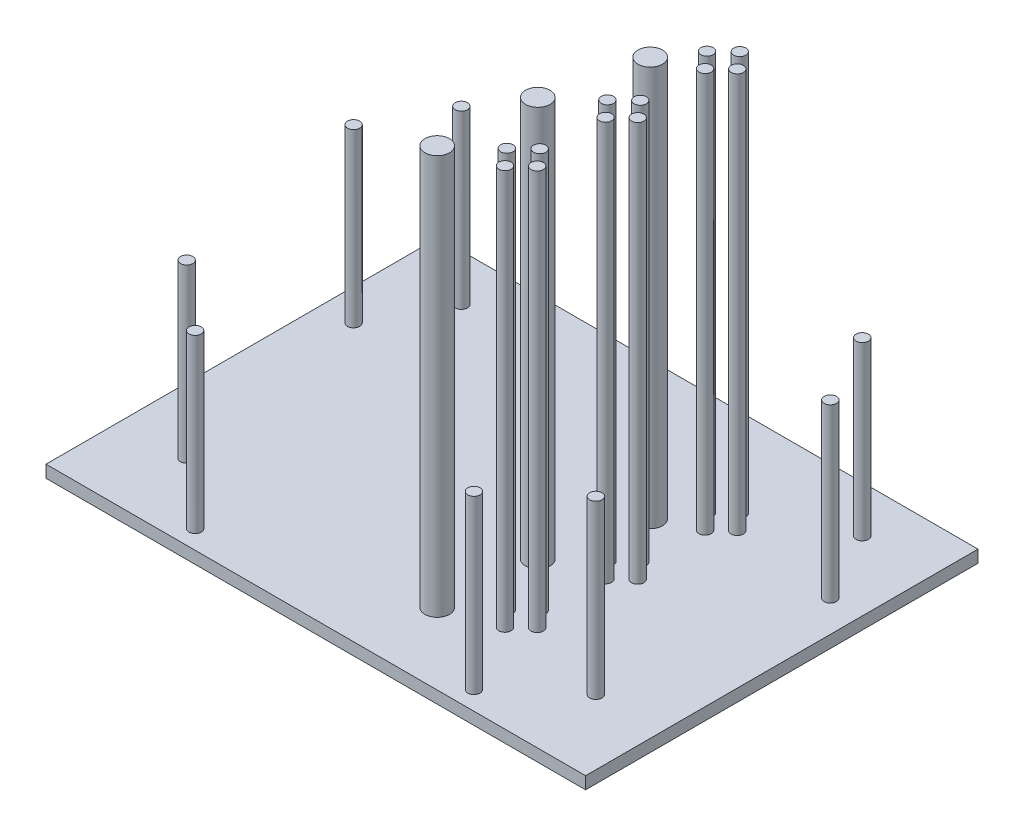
ISO-10303-21;
HEADER;
FILE_DESCRIPTION(('STEP AP214'),'2;1');
FILE_NAME('part.step','',(''),(''),'','','');
FILE_SCHEMA(('AUTOMOTIVE_DESIGN { 1 0 10303 214 1 1 1 1 }'));
ENDSEC;
DATA;
#1=APPLICATION_CONTEXT('core data for automotive mechanical design processes');
#2=APPLICATION_PROTOCOL_DEFINITION('international standard','automotive_design',2000,#1);
#3=PRODUCT_CONTEXT('',#1,'mechanical');
#4=PRODUCT('Part','Part','',(#3));
#5=PRODUCT_RELATED_PRODUCT_CATEGORY('part','',(#4));
#6=PRODUCT_DEFINITION_FORMATION('','',#4);
#7=PRODUCT_DEFINITION_CONTEXT('part definition',#1,'design');
#8=PRODUCT_DEFINITION('design','',#6,#7);
#9=PRODUCT_DEFINITION_SHAPE('','',#8);
#10=(LENGTH_UNIT() NAMED_UNIT(*) SI_UNIT(.MILLI.,.METRE.));
#11=(NAMED_UNIT(*) PLANE_ANGLE_UNIT() SI_UNIT($,.RADIAN.));
#12=(NAMED_UNIT(*) SI_UNIT($,.STERADIAN.) SOLID_ANGLE_UNIT());
#13=UNCERTAINTY_MEASURE_WITH_UNIT(LENGTH_MEASURE(1.E-05),#10,'distance_accuracy_value','');
#14=(GEOMETRIC_REPRESENTATION_CONTEXT(3) GLOBAL_UNCERTAINTY_ASSIGNED_CONTEXT((#13)) GLOBAL_UNIT_ASSIGNED_CONTEXT((#10,
#11,#12)) REPRESENTATION_CONTEXT('',''));
#15=CARTESIAN_POINT('',(0.,0.,0.));
#16=DIRECTION('',(0.,0.,1.));
#17=DIRECTION('',(1.,0.,0.));
#18=AXIS2_PLACEMENT_3D('',#15,#16,#17);
#19=CARTESIAN_POINT('',(194.359466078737,0.,-65.1969442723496));
#20=DIRECTION('',(0.,1.,0.));
#21=DIRECTION('',(0.,0.,1.));
#22=AXIS2_PLACEMENT_3D('',#19,#20,#21);
#23=PLANE('',#22);
#24=CARTESIAN_POINT('',(194.359466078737,0.,-65.1969442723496));
#25=DIRECTION('',(0.,1.,0.));
#26=DIRECTION('',(0.,0.,1.));
#27=AXIS2_PLACEMENT_3D('',#24,#25,#26);
#28=CIRCLE('',#27,5.00000000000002);
#29=CARTESIAN_POINT('',(194.359466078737,0.,-60.1969442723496));
#30=VERTEX_POINT('',#29);
#31=EDGE_CURVE('E113',#30,#30,#28,.T.);
#32=ORIENTED_EDGE('',*,*,#31,.T.);
#33=EDGE_LOOP('',(#32));
#34=FACE_BOUND('',#33,.T.);
#35=ADVANCED_FACE('F32',(#34),#23,.T.);
#36=CARTESIAN_POINT('',(194.359466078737,-164.142135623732,-65.1969442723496));
#37=DIRECTION('',(0.,1.,0.));
#38=DIRECTION('',(0.,0.,1.));
#39=AXIS2_PLACEMENT_3D('',#36,#37,#38);
#40=CYLINDRICAL_SURFACE('',#39,5.00000000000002);
#41=CARTESIAN_POINT('',(194.359466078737,-140.000000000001,-65.1969442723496));
#42=DIRECTION('',(0.,1.,0.));
#43=DIRECTION('',(-1.,0.,0.));
#44=AXIS2_PLACEMENT_3D('',#41,#42,#43);
#45=CIRCLE('',#44,5.00000000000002);
#46=CARTESIAN_POINT('',(189.359466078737,-140.000000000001,-65.1969442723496));
#47=VERTEX_POINT('',#46);
#48=EDGE_CURVE('E36',#47,#47,#45,.F.);
#49=ORIENTED_EDGE('',*,*,#48,.F.);
#50=EDGE_LOOP('',(#49));
#51=FACE_BOUND('',#50,.T.);
#52=ORIENTED_EDGE('',*,*,#31,.F.);
#53=EDGE_LOOP('',(#52));
#54=FACE_BOUND('',#53,.T.);
#55=ADVANCED_FACE('F263',(#51,#54),#40,.T.);
#56=CARTESIAN_POINT('',(-220.000000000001,-139.999999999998,160.));
#57=DIRECTION('',(-1.,0.,0.));
#58=DIRECTION('',(0.,-1.,0.));
#59=AXIS2_PLACEMENT_3D('',#56,#57,#58);
#60=PLANE('',#59);
#61=DIRECTION('',(0.,0.,-1.));
#62=VECTOR('',#61,1.);
#63=CARTESIAN_POINT('',(-220.000000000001,-149.999999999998,160.));
#64=LINE('',#63,#62);
#65=CARTESIAN_POINT('',(-220.000000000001,-149.999999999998,160.));
#66=VERTEX_POINT('',#65);
#67=CARTESIAN_POINT('',(-220.000000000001,-149.999999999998,-160.));
#68=VERTEX_POINT('',#67);
#69=EDGE_CURVE('E103',#66,#68,#64,.T.);
#70=ORIENTED_EDGE('',*,*,#69,.F.);
#71=DIRECTION('',(0.,-1.,0.));
#72=VECTOR('',#71,1.);
#73=CARTESIAN_POINT('',(-220.000000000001,-139.999999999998,160.));
#74=LINE('',#73,#72);
#75=CARTESIAN_POINT('',(-220.000000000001,-139.999999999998,160.));
#76=VERTEX_POINT('',#75);
#77=EDGE_CURVE('E51',#76,#66,#74,.T.);
#78=ORIENTED_EDGE('',*,*,#77,.F.);
#79=DIRECTION('',(0.,0.,-1.));
#80=VECTOR('',#79,1.);
#81=CARTESIAN_POINT('',(-220.000000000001,-139.999999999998,160.));
#82=LINE('',#81,#80);
#83=CARTESIAN_POINT('',(-220.000000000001,-139.999999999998,-160.));
#84=VERTEX_POINT('',#83);
#85=EDGE_CURVE('E96',#76,#84,#82,.T.);
#86=ORIENTED_EDGE('',*,*,#85,.T.);
#87=DIRECTION('',(0.,-1.,0.));
#88=VECTOR('',#87,1.);
#89=CARTESIAN_POINT('',(-220.000000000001,-139.999999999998,-160.));
#90=LINE('',#89,#88);
#91=EDGE_CURVE('E79',#84,#68,#90,.T.);
#92=ORIENTED_EDGE('',*,*,#91,.T.);
#93=EDGE_LOOP('',(#70,#78,#86,#92));
#94=FACE_BOUND('',#93,.T.);
#95=ADVANCED_FACE('F268',(#94),#60,.T.);
#96=CARTESIAN_POINT('',(219.999999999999,-140.000000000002,160.));
#97=DIRECTION('',(0.,0.,1.));
#98=DIRECTION('',(1.,0.,0.));
#99=AXIS2_PLACEMENT_3D('',#96,#97,#98);
#100=PLANE('',#99);
#101=DIRECTION('',(-1.,0.,0.));
#102=VECTOR('',#101,1.);
#103=CARTESIAN_POINT('',(219.999999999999,-150.000000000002,160.));
#104=LINE('',#103,#102);
#105=CARTESIAN_POINT('',(219.999999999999,-150.000000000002,160.));
#106=VERTEX_POINT('',#105);
#107=EDGE_CURVE('E98',#106,#66,#104,.T.);
#108=ORIENTED_EDGE('',*,*,#107,.F.);
#109=DIRECTION('',(0.,-1.,0.));
#110=VECTOR('',#109,1.);
#111=CARTESIAN_POINT('',(219.999999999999,-140.000000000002,160.));
#112=LINE('',#111,#110);
#113=CARTESIAN_POINT('',(219.999999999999,-140.000000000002,160.));
#114=VERTEX_POINT('',#113);
#115=EDGE_CURVE('E68',#114,#106,#112,.T.);
#116=ORIENTED_EDGE('',*,*,#115,.F.);
#117=DIRECTION('',(-1.,0.,0.));
#118=VECTOR('',#117,1.);
#119=CARTESIAN_POINT('',(219.999999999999,-140.000000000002,160.));
#120=LINE('',#119,#118);
#121=EDGE_CURVE('E93',#114,#76,#120,.T.);
#122=ORIENTED_EDGE('',*,*,#121,.T.);
#123=ORIENTED_EDGE('',*,*,#77,.T.);
#124=EDGE_LOOP('',(#108,#116,#122,#123));
#125=FACE_BOUND('',#124,.T.);
#126=ADVANCED_FACE('F273',(#125),#100,.T.);
#127=CARTESIAN_POINT('',(219.999999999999,-140.000000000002,160.));
#128=DIRECTION('',(1.,0.,0.));
#129=DIRECTION('',(0.,1.,0.));
#130=AXIS2_PLACEMENT_3D('',#127,#128,#129);
#131=PLANE('',#130);
#132=DIRECTION('',(0.,0.,1.));
#133=VECTOR('',#132,1.);
#134=CARTESIAN_POINT('',(219.999999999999,-150.000000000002,160.));
#135=LINE('',#134,#133);
#136=CARTESIAN_POINT('',(219.999999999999,-150.000000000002,-160.));
#137=VERTEX_POINT('',#136);
#138=EDGE_CURVE('E87',#137,#106,#135,.T.);
#139=ORIENTED_EDGE('',*,*,#138,.F.);
#140=DIRECTION('',(0.,-1.,0.));
#141=VECTOR('',#140,1.);
#142=CARTESIAN_POINT('',(219.999999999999,-140.000000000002,-160.));
#143=LINE('',#142,#141);
#144=CARTESIAN_POINT('',(219.999999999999,-140.000000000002,-160.));
#145=VERTEX_POINT('',#144);
#146=EDGE_CURVE('E82',#145,#137,#143,.T.);
#147=ORIENTED_EDGE('',*,*,#146,.F.);
#148=DIRECTION('',(0.,0.,1.));
#149=VECTOR('',#148,1.);
#150=CARTESIAN_POINT('',(219.999999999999,-140.000000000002,160.));
#151=LINE('',#150,#149);
#152=EDGE_CURVE('E85',#145,#114,#151,.T.);
#153=ORIENTED_EDGE('',*,*,#152,.T.);
#154=ORIENTED_EDGE('',*,*,#115,.T.);
#155=EDGE_LOOP('',(#139,#147,#153,#154));
#156=FACE_BOUND('',#155,.T.);
#157=ADVANCED_FACE('F84',(#156),#131,.T.);
#158=CARTESIAN_POINT('',(219.999999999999,-140.000000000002,-160.));
#159=DIRECTION('',(0.,0.,-1.));
#160=DIRECTION('',(-1.,0.,0.));
#161=AXIS2_PLACEMENT_3D('',#158,#159,#160);
#162=PLANE('',#161);
#163=DIRECTION('',(1.,0.,0.));
#164=VECTOR('',#163,1.);
#165=CARTESIAN_POINT('',(219.999999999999,-150.000000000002,-160.));
#166=LINE('',#165,#164);
#167=EDGE_CURVE('E106',#68,#137,#166,.T.);
#168=ORIENTED_EDGE('',*,*,#167,.F.);
#169=ORIENTED_EDGE('',*,*,#91,.F.);
#170=DIRECTION('',(1.,0.,0.));
#171=VECTOR('',#170,1.);
#172=CARTESIAN_POINT('',(219.999999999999,-140.000000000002,-160.));
#173=LINE('',#172,#171);
#174=EDGE_CURVE('E92',#84,#145,#173,.T.);
#175=ORIENTED_EDGE('',*,*,#174,.T.);
#176=ORIENTED_EDGE('',*,*,#146,.T.);
#177=EDGE_LOOP('',(#168,#169,#175,#176));
#178=FACE_BOUND('',#177,.T.);
#179=ADVANCED_FACE('F95',(#178),#162,.T.);
#180=CARTESIAN_POINT('',(-9.71004458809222E-13,-140.,0.));
#181=DIRECTION('',(0.,1.,0.));
#182=DIRECTION('',(-1.,0.,0.));
#183=AXIS2_PLACEMENT_3D('',#180,#181,#182);
#184=PLANE('',#183);
#185=CARTESIAN_POINT('',(83.8307289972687,-140.000000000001,-75.1681829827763));
#186=DIRECTION('',(0.,1.,0.));
#187=DIRECTION('',(-1.,0.,0.));
#188=AXIS2_PLACEMENT_3D('',#185,#186,#187);
#189=CIRCLE('',#188,5.00000000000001);
#190=CARTESIAN_POINT('',(83.8307289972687,-140.000000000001,-70.1681829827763));
#191=VERTEX_POINT('',#190);
#192=EDGE_CURVE('E244',#191,#191,#189,.F.);
#193=ORIENTED_EDGE('',*,*,#192,.T.);
#194=EDGE_LOOP('',(#193));
#195=FACE_BOUND('',#194,.T.);
#196=CARTESIAN_POINT('',(95.3502882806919,-140.000000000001,-62.1163718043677));
#197=DIRECTION('',(0.,1.,0.));
#198=DIRECTION('',(-1.,0.,0.));
#199=AXIS2_PLACEMENT_3D('',#196,#197,#198);
#200=CIRCLE('',#199,5.00000000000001);
#201=CARTESIAN_POINT('',(95.3502882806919,-140.000000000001,-57.1163718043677));
#202=VERTEX_POINT('',#201);
#203=EDGE_CURVE('E238',#202,#202,#200,.F.);
#204=ORIENTED_EDGE('',*,*,#203,.T.);
#205=EDGE_LOOP('',(#204));
#206=FACE_BOUND('',#205,.T.);
#207=CARTESIAN_POINT('',(108.71705253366,-140.000000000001,-74.9999999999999));
#208=DIRECTION('',(0.,1.,0.));
#209=DIRECTION('',(-1.,0.,0.));
#210=AXIS2_PLACEMENT_3D('',#207,#208,#209);
#211=CIRCLE('',#210,5.00000000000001);
#212=CARTESIAN_POINT('',(108.71705253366,-140.000000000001,-69.9999999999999));
#213=VERTEX_POINT('',#212);
#214=EDGE_CURVE('E232',#213,#213,#211,.F.);
#215=ORIENTED_EDGE('',*,*,#214,.T.);
#216=EDGE_LOOP('',(#215));
#217=FACE_BOUND('',#216,.T.);
#218=CARTESIAN_POINT('',(91.3255151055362,-140.000000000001,-13.2422029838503));
#219=DIRECTION('',(0.,1.,0.));
#220=DIRECTION('',(-1.,0.,0.));
#221=AXIS2_PLACEMENT_3D('',#218,#219,#220);
#222=CIRCLE('',#221,5.00000000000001);
#223=CARTESIAN_POINT('',(91.3255151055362,-140.000000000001,-8.24220298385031));
#224=VERTEX_POINT('',#223);
#225=EDGE_CURVE('E226',#224,#224,#222,.F.);
#226=ORIENTED_EDGE('',*,*,#225,.T.);
#227=EDGE_LOOP('',(#226));
#228=FACE_BOUND('',#227,.T.);
#229=CARTESIAN_POINT('',(77.623904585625,-140.000000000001,-0.16818298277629));
#230=DIRECTION('',(0.,1.,0.));
#231=DIRECTION('',(-1.,0.,0.));
#232=AXIS2_PLACEMENT_3D('',#229,#230,#231);
#233=CIRCLE('',#232,5.00000000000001);
#234=CARTESIAN_POINT('',(77.623904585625,-140.000000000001,4.83181701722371));
#235=VERTEX_POINT('',#234);
#236=EDGE_CURVE('E220',#235,#235,#233,.F.);
#237=ORIENTED_EDGE('',*,*,#236,.T.);
#238=EDGE_LOOP('',(#237));
#239=FACE_BOUND('',#238,.T.);
#240=CARTESIAN_POINT('',(89.1434638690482,-140.000000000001,12.8836281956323));
#241=DIRECTION('',(0.,1.,0.));
#242=DIRECTION('',(-1.,0.,0.));
#243=AXIS2_PLACEMENT_3D('',#240,#241,#242);
#244=CIRCLE('',#243,5.00000000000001);
#245=CARTESIAN_POINT('',(89.1434638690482,-140.000000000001,17.8836281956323));
#246=VERTEX_POINT('',#245);
#247=EDGE_CURVE('E214',#246,#246,#244,.F.);
#248=ORIENTED_EDGE('',*,*,#247,.T.);
#249=EDGE_LOOP('',(#248));
#250=FACE_BOUND('',#249,.T.);
#251=CARTESIAN_POINT('',(102.510228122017,-140.000000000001,0.));
#252=DIRECTION('',(0.,1.,0.));
#253=DIRECTION('',(-1.,0.,0.));
#254=AXIS2_PLACEMENT_3D('',#251,#252,#253);
#255=CIRCLE('',#254,5.00000000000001);
#256=CARTESIAN_POINT('',(102.510228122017,-140.000000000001,5.00000000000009));
#257=VERTEX_POINT('',#256);
#258=EDGE_CURVE('E208',#257,#257,#255,.F.);
#259=ORIENTED_EDGE('',*,*,#258,.T.);
#260=EDGE_LOOP('',(#259));
#261=FACE_BOUND('',#260,.T.);
#262=CARTESIAN_POINT('',(84.5107270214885,-140.000000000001,61.925979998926));
#263=DIRECTION('',(0.,1.,0.));
#264=DIRECTION('',(-1.,0.,0.));
#265=AXIS2_PLACEMENT_3D('',#262,#263,#264);
#266=CIRCLE('',#265,5.00000000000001);
#267=CARTESIAN_POINT('',(84.5107270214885,-140.000000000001,66.9259799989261));
#268=VERTEX_POINT('',#267);
#269=EDGE_CURVE('E202',#268,#268,#266,.F.);
#270=ORIENTED_EDGE('',*,*,#269,.T.);
#271=EDGE_LOOP('',(#270));
#272=FACE_BOUND('',#271,.T.);
#273=CARTESIAN_POINT('',(70.8091165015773,-140.,75.0000000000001));
#274=DIRECTION('',(0.,1.,0.));
#275=DIRECTION('',(-1.,0.,0.));
#276=AXIS2_PLACEMENT_3D('',#273,#274,#275);
#277=CIRCLE('',#276,5.00000000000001);
#278=CARTESIAN_POINT('',(70.8091165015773,-140.,80.0000000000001));
#279=VERTEX_POINT('',#278);
#280=EDGE_CURVE('E196',#279,#279,#277,.F.);
#281=ORIENTED_EDGE('',*,*,#280,.T.);
#282=EDGE_LOOP('',(#281));
#283=FACE_BOUND('',#282,.T.);
#284=CARTESIAN_POINT('',(82.3286757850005,-140.000000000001,88.0518111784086));
#285=DIRECTION('',(0.,1.,0.));
#286=DIRECTION('',(-1.,0.,0.));
#287=AXIS2_PLACEMENT_3D('',#284,#285,#286);
#288=CIRCLE('',#287,5.00000000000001);
#289=CARTESIAN_POINT('',(82.3286757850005,-140.000000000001,93.0518111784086));
#290=VERTEX_POINT('',#289);
#291=EDGE_CURVE('E190',#290,#290,#288,.F.);
#292=ORIENTED_EDGE('',*,*,#291,.T.);
#293=EDGE_LOOP('',(#292));
#294=FACE_BOUND('',#293,.T.);
#295=CARTESIAN_POINT('',(95.6954400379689,-140.000000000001,75.1681829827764));
#296=DIRECTION('',(0.,1.,0.));
#297=DIRECTION('',(-1.,0.,0.));
#298=AXIS2_PLACEMENT_3D('',#295,#296,#297);
#299=CIRCLE('',#298,5.00000000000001);
#300=CARTESIAN_POINT('',(95.6954400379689,-140.000000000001,80.1681829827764));
#301=VERTEX_POINT('',#300);
#302=EDGE_CURVE('E184',#301,#301,#299,.F.);
#303=ORIENTED_EDGE('',*,*,#302,.T.);
#304=EDGE_LOOP('',(#303));
#305=FACE_BOUND('',#304,.T.);
#306=CARTESIAN_POINT('',(64.8818836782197,-140.,-47.8251607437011));
#307=DIRECTION('',(0.,1.,0.));
#308=DIRECTION('',(-1.,0.,0.));
#309=AXIS2_PLACEMENT_3D('',#306,#307,#308);
#310=CIRCLE('',#309,10.);
#311=CARTESIAN_POINT('',(64.8818836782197,-140.,-37.8251607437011));
#312=VERTEX_POINT('',#311);
#313=EDGE_CURVE('E178',#312,#312,#310,.F.);
#314=ORIENTED_EDGE('',*,*,#313,.T.);
#315=EDGE_LOOP('',(#314));
#316=FACE_BOUND('',#315,.T.);
#317=CARTESIAN_POINT('',(47.432717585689,-140.,26.4114378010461));
#318=DIRECTION('',(0.,1.,0.));
#319=DIRECTION('',(-1.,0.,0.));
#320=AXIS2_PLACEMENT_3D('',#317,#318,#319);
#321=CIRCLE('',#320,10.);
#322=CARTESIAN_POINT('',(47.432717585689,-140.,36.4114378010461));
#323=VERTEX_POINT('',#322);
#324=EDGE_CURVE('E172',#323,#323,#321,.F.);
#325=ORIENTED_EDGE('',*,*,#324,.T.);
#326=EDGE_LOOP('',(#325));
#327=FACE_BOUND('',#326,.T.);
#328=CARTESIAN_POINT('',(40.6179295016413,-140.,101.579620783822));
#329=DIRECTION('',(0.,1.,0.));
#330=DIRECTION('',(-1.,0.,0.));
#331=AXIS2_PLACEMENT_3D('',#328,#329,#330);
#332=CIRCLE('',#331,10.);
#333=CARTESIAN_POINT('',(40.6179295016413,-140.,111.579620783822));
#334=VERTEX_POINT('',#333);
#335=EDGE_CURVE('E166',#334,#334,#332,.F.);
#336=ORIENTED_EDGE('',*,*,#335,.T.);
#337=EDGE_LOOP('',(#336));
#338=FACE_BOUND('',#337,.T.);
#339=CARTESIAN_POINT('',(97.5323395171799,-140.000000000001,-88.2422029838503));
#340=DIRECTION('',(0.,1.,0.));
#341=DIRECTION('',(-1.,0.,0.));
#342=AXIS2_PLACEMENT_3D('',#339,#340,#341);
#343=CIRCLE('',#342,5.00000000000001);
#344=CARTESIAN_POINT('',(97.5323395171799,-140.000000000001,-83.2422029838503));
#345=VERTEX_POINT('',#344);
#346=EDGE_CURVE('E160',#345,#345,#343,.F.);
#347=ORIENTED_EDGE('',*,*,#346,.T.);
#348=EDGE_LOOP('',(#347));
#349=FACE_BOUND('',#348,.T.);
#350=CARTESIAN_POINT('',(-113.66820880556,-139.999999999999,144.702587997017));
#351=DIRECTION('',(0.,1.,0.));
#352=DIRECTION('',(-1.,0.,0.));
#353=AXIS2_PLACEMENT_3D('',#350,#351,#352);
#354=CIRCLE('',#353,5.00000000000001);
#355=CARTESIAN_POINT('',(-118.66820880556,-139.999999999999,144.702587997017));
#356=VERTEX_POINT('',#355);
#357=EDGE_CURVE('E11',#356,#356,#354,.T.);
#358=ORIENTED_EDGE('',*,*,#357,.F.);
#359=EDGE_LOOP('',(#358));
#360=FACE_BOUND('',#359,.T.);
#361=CARTESIAN_POINT('',(-166.824324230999,-139.999999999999,98.471006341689));
#362=DIRECTION('',(0.,1.,0.));
#363=DIRECTION('',(-1.,0.,0.));
#364=AXIS2_PLACEMENT_3D('',#361,#362,#363);
#365=CIRCLE('',#364,5.00000000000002);
#366=CARTESIAN_POINT('',(-171.824324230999,-139.999999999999,98.471006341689));
#367=VERTEX_POINT('',#366);
#368=EDGE_CURVE('E42',#367,#367,#365,.T.);
#369=ORIENTED_EDGE('',*,*,#368,.F.);
#370=EDGE_LOOP('',(#369));
#371=FACE_BOUND('',#370,.T.);
#372=CARTESIAN_POINT('',(-194.359466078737,-139.999999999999,-65.1969442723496));
#373=DIRECTION('',(0.,1.,0.));
#374=DIRECTION('',(-1.,0.,0.));
#375=AXIS2_PLACEMENT_3D('',#372,#373,#374);
#376=CIRCLE('',#375,5.00000000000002);
#377=CARTESIAN_POINT('',(-199.359466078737,-139.999999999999,-65.1969442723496));
#378=VERTEX_POINT('',#377);
#379=EDGE_CURVE('E144',#378,#378,#376,.T.);
#380=ORIENTED_EDGE('',*,*,#379,.F.);
#381=EDGE_LOOP('',(#380));
#382=FACE_BOUND('',#381,.T.);
#383=CARTESIAN_POINT('',(113.66820880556,-140.000000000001,144.702587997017));
#384=DIRECTION('',(0.,1.,0.));
#385=DIRECTION('',(-1.,0.,0.));
#386=AXIS2_PLACEMENT_3D('',#383,#384,#385);
#387=CIRCLE('',#386,5.00000000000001);
#388=CARTESIAN_POINT('',(108.66820880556,-140.000000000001,144.702587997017));
#389=VERTEX_POINT('',#388);
#390=EDGE_CURVE('E138',#389,#389,#387,.T.);
#391=ORIENTED_EDGE('',*,*,#390,.F.);
#392=EDGE_LOOP('',(#391));
#393=FACE_BOUND('',#392,.T.);
#394=CARTESIAN_POINT('',(-163.468530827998,-139.999999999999,-122.146855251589));
#395=DIRECTION('',(0.,1.,0.));
#396=DIRECTION('',(-1.,0.,0.));
#397=AXIS2_PLACEMENT_3D('',#394,#395,#396);
#398=CIRCLE('',#397,4.99999999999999);
#399=CARTESIAN_POINT('',(-168.468530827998,-139.999999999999,-122.146855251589));
#400=VERTEX_POINT('',#399);
#401=EDGE_CURVE('E127',#400,#400,#398,.T.);
#402=ORIENTED_EDGE('',*,*,#401,.F.);
#403=EDGE_LOOP('',(#402));
#404=FACE_BOUND('',#403,.T.);
#405=CARTESIAN_POINT('',(163.468530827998,-140.000000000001,-122.146855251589));
#406=DIRECTION('',(0.,1.,0.));
#407=DIRECTION('',(-1.,0.,0.));
#408=AXIS2_PLACEMENT_3D('',#405,#406,#407);
#409=CIRCLE('',#408,4.99999999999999);
#410=CARTESIAN_POINT('',(158.468530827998,-140.000000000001,-122.146855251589));
#411=VERTEX_POINT('',#410);
#412=EDGE_CURVE('E123',#411,#411,#409,.T.);
#413=ORIENTED_EDGE('',*,*,#412,.F.);
#414=EDGE_LOOP('',(#413));
#415=FACE_BOUND('',#414,.T.);
#416=CARTESIAN_POINT('',(166.824324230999,-140.000000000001,98.471006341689));
#417=DIRECTION('',(0.,1.,0.));
#418=DIRECTION('',(-1.,0.,0.));
#419=AXIS2_PLACEMENT_3D('',#416,#417,#418);
#420=CIRCLE('',#419,5.00000000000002);
#421=CARTESIAN_POINT('',(161.824324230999,-140.000000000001,98.471006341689));
#422=VERTEX_POINT('',#421);
#423=EDGE_CURVE('E119',#422,#422,#420,.T.);
#424=ORIENTED_EDGE('',*,*,#423,.F.);
#425=EDGE_LOOP('',(#424));
#426=FACE_BOUND('',#425,.T.);
#427=ORIENTED_EDGE('',*,*,#48,.T.);
#428=EDGE_LOOP('',(#427));
#429=FACE_BOUND('',#428,.T.);
#430=ORIENTED_EDGE('',*,*,#85,.F.);
#431=ORIENTED_EDGE('',*,*,#121,.F.);
#432=ORIENTED_EDGE('',*,*,#152,.F.);
#433=ORIENTED_EDGE('',*,*,#174,.F.);
#434=EDGE_LOOP('',(#430,#431,#432,#433));
#435=FACE_BOUND('',#434,.T.);
#436=ADVANCED_FACE('F91',(#195,#206,#217,#228,#239,#250,#261,#272,#283,#294,#305,#316,#327,#338,
#349,#360,#371,#382,#393,#404,#415,#426,#429,#435),#184,.T.);
#437=CARTESIAN_POINT('',(0.,-150.,0.));
#438=DIRECTION('',(0.,-1.,0.));
#439=DIRECTION('',(1.,0.,0.));
#440=AXIS2_PLACEMENT_3D('',#437,#438,#439);
#441=PLANE('',#440);
#442=ORIENTED_EDGE('',*,*,#69,.T.);
#443=ORIENTED_EDGE('',*,*,#167,.T.);
#444=ORIENTED_EDGE('',*,*,#138,.T.);
#445=ORIENTED_EDGE('',*,*,#107,.T.);
#446=EDGE_LOOP('',(#442,#443,#444,#445));
#447=FACE_BOUND('',#446,.T.);
#448=ADVANCED_FACE('F34',(#447),#441,.T.);
#449=CARTESIAN_POINT('',(166.824324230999,0.,98.471006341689));
#450=DIRECTION('',(0.,1.,0.));
#451=DIRECTION('',(0.,0.,1.));
#452=AXIS2_PLACEMENT_3D('',#449,#450,#451);
#453=PLANE('',#452);
#454=CARTESIAN_POINT('',(166.824324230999,0.,98.471006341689));
#455=DIRECTION('',(0.,1.,0.));
#456=DIRECTION('',(0.,0.,1.));
#457=AXIS2_PLACEMENT_3D('',#454,#455,#456);
#458=CIRCLE('',#457,5.00000000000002);
#459=CARTESIAN_POINT('',(166.824324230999,0.,103.471006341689));
#460=VERTEX_POINT('',#459);
#461=EDGE_CURVE('E107',#460,#460,#458,.T.);
#462=ORIENTED_EDGE('',*,*,#461,.T.);
#463=EDGE_LOOP('',(#462));
#464=FACE_BOUND('',#463,.T.);
#465=ADVANCED_FACE('F287',(#464),#453,.T.);
#466=CARTESIAN_POINT('',(166.824324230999,-164.142135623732,98.471006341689));
#467=DIRECTION('',(0.,1.,0.));
#468=DIRECTION('',(0.,0.,1.));
#469=AXIS2_PLACEMENT_3D('',#466,#467,#468);
#470=CYLINDRICAL_SURFACE('',#469,5.00000000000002);
#471=ORIENTED_EDGE('',*,*,#423,.T.);
#472=EDGE_LOOP('',(#471));
#473=FACE_BOUND('',#472,.T.);
#474=ORIENTED_EDGE('',*,*,#461,.F.);
#475=EDGE_LOOP('',(#474));
#476=FACE_BOUND('',#475,.T.);
#477=ADVANCED_FACE('F283',(#473,#476),#470,.T.);
#478=CARTESIAN_POINT('',(163.468530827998,0.,-122.146855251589));
#479=DIRECTION('',(0.,1.,0.));
#480=DIRECTION('',(0.,0.,1.));
#481=AXIS2_PLACEMENT_3D('',#478,#479,#480);
#482=PLANE('',#481);
#483=CARTESIAN_POINT('',(163.468530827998,0.,-122.146855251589));
#484=DIRECTION('',(0.,1.,0.));
#485=DIRECTION('',(0.,0.,1.));
#486=AXIS2_PLACEMENT_3D('',#483,#484,#485);
#487=CIRCLE('',#486,4.99999999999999);
#488=CARTESIAN_POINT('',(163.468530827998,0.,-117.146855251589));
#489=VERTEX_POINT('',#488);
#490=EDGE_CURVE('E131',#489,#489,#487,.T.);
#491=ORIENTED_EDGE('',*,*,#490,.T.);
#492=EDGE_LOOP('',(#491));
#493=FACE_BOUND('',#492,.T.);
#494=ADVANCED_FACE('F286',(#493),#482,.T.);
#495=CARTESIAN_POINT('',(163.468530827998,-164.142135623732,-122.146855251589));
#496=DIRECTION('',(0.,1.,0.));
#497=DIRECTION('',(0.,0.,1.));
#498=AXIS2_PLACEMENT_3D('',#495,#496,#497);
#499=CYLINDRICAL_SURFACE('',#498,4.99999999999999);
#500=ORIENTED_EDGE('',*,*,#412,.T.);
#501=EDGE_LOOP('',(#500));
#502=FACE_BOUND('',#501,.T.);
#503=ORIENTED_EDGE('',*,*,#490,.F.);
#504=EDGE_LOOP('',(#503));
#505=FACE_BOUND('',#504,.T.);
#506=ADVANCED_FACE('F291',(#502,#505),#499,.T.);
#507=CARTESIAN_POINT('',(-163.468530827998,0.,-122.146855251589));
#508=DIRECTION('',(0.,-1.,0.));
#509=DIRECTION('',(0.,0.,-1.));
#510=AXIS2_PLACEMENT_3D('',#507,#508,#509);
#511=PLANE('',#510);
#512=CARTESIAN_POINT('',(-163.468530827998,0.,-122.146855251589));
#513=DIRECTION('',(0.,1.,0.));
#514=DIRECTION('',(0.,0.,-1.));
#515=AXIS2_PLACEMENT_3D('',#512,#513,#514);
#516=CIRCLE('',#515,4.99999999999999);
#517=CARTESIAN_POINT('',(-163.468530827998,0.,-127.146855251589));
#518=VERTEX_POINT('',#517);
#519=EDGE_CURVE('E135',#518,#518,#516,.T.);
#520=ORIENTED_EDGE('',*,*,#519,.T.);
#521=EDGE_LOOP('',(#520));
#522=FACE_BOUND('',#521,.T.);
#523=ADVANCED_FACE('F294',(#522),#511,.F.);
#524=CARTESIAN_POINT('',(-163.468530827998,-164.142135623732,-122.146855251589));
#525=DIRECTION('',(0.,1.,0.));
#526=DIRECTION('',(0.,0.,1.));
#527=AXIS2_PLACEMENT_3D('',#524,#525,#526);
#528=CYLINDRICAL_SURFACE('',#527,4.99999999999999);
#529=ORIENTED_EDGE('',*,*,#401,.T.);
#530=EDGE_LOOP('',(#529));
#531=FACE_BOUND('',#530,.T.);
#532=ORIENTED_EDGE('',*,*,#519,.F.);
#533=EDGE_LOOP('',(#532));
#534=FACE_BOUND('',#533,.T.);
#535=ADVANCED_FACE('F299',(#531,#534),#528,.T.);
#536=CARTESIAN_POINT('',(113.66820880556,0.,144.702587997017));
#537=DIRECTION('',(0.,1.,0.));
#538=DIRECTION('',(0.,0.,1.));
#539=AXIS2_PLACEMENT_3D('',#536,#537,#538);
#540=PLANE('',#539);
#541=CARTESIAN_POINT('',(113.66820880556,0.,144.702587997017));
#542=DIRECTION('',(0.,1.,0.));
#543=DIRECTION('',(0.,0.,1.));
#544=AXIS2_PLACEMENT_3D('',#541,#542,#543);
#545=CIRCLE('',#544,5.00000000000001);
#546=CARTESIAN_POINT('',(113.66820880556,0.,149.702587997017));
#547=VERTEX_POINT('',#546);
#548=EDGE_CURVE('E141',#547,#547,#545,.T.);
#549=ORIENTED_EDGE('',*,*,#548,.T.);
#550=EDGE_LOOP('',(#549));
#551=FACE_BOUND('',#550,.T.);
#552=ADVANCED_FACE('F302',(#551),#540,.T.);
#553=CARTESIAN_POINT('',(113.66820880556,-164.142135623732,144.702587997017));
#554=DIRECTION('',(0.,1.,0.));
#555=DIRECTION('',(0.,0.,1.));
#556=AXIS2_PLACEMENT_3D('',#553,#554,#555);
#557=CYLINDRICAL_SURFACE('',#556,5.00000000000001);
#558=ORIENTED_EDGE('',*,*,#390,.T.);
#559=EDGE_LOOP('',(#558));
#560=FACE_BOUND('',#559,.T.);
#561=ORIENTED_EDGE('',*,*,#548,.F.);
#562=EDGE_LOOP('',(#561));
#563=FACE_BOUND('',#562,.T.);
#564=ADVANCED_FACE('F307',(#560,#563),#557,.T.);
#565=CARTESIAN_POINT('',(-194.359466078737,0.,-65.1969442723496));
#566=DIRECTION('',(0.,-1.,0.));
#567=DIRECTION('',(0.,0.,-1.));
#568=AXIS2_PLACEMENT_3D('',#565,#566,#567);
#569=PLANE('',#568);
#570=CARTESIAN_POINT('',(-194.359466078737,0.,-65.1969442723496));
#571=DIRECTION('',(0.,1.,0.));
#572=DIRECTION('',(0.,0.,-1.));
#573=AXIS2_PLACEMENT_3D('',#570,#571,#572);
#574=CIRCLE('',#573,5.00000000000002);
#575=CARTESIAN_POINT('',(-194.359466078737,0.,-70.1969442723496));
#576=VERTEX_POINT('',#575);
#577=EDGE_CURVE('E147',#576,#576,#574,.T.);
#578=ORIENTED_EDGE('',*,*,#577,.T.);
#579=EDGE_LOOP('',(#578));
#580=FACE_BOUND('',#579,.T.);
#581=ADVANCED_FACE('F310',(#580),#569,.F.);
#582=CARTESIAN_POINT('',(-194.359466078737,-164.142135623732,-65.1969442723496));
#583=DIRECTION('',(0.,1.,0.));
#584=DIRECTION('',(0.,0.,1.));
#585=AXIS2_PLACEMENT_3D('',#582,#583,#584);
#586=CYLINDRICAL_SURFACE('',#585,5.00000000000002);
#587=ORIENTED_EDGE('',*,*,#379,.T.);
#588=EDGE_LOOP('',(#587));
#589=FACE_BOUND('',#588,.T.);
#590=ORIENTED_EDGE('',*,*,#577,.F.);
#591=EDGE_LOOP('',(#590));
#592=FACE_BOUND('',#591,.T.);
#593=ADVANCED_FACE('F315',(#589,#592),#586,.T.);
#594=CARTESIAN_POINT('',(-166.824324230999,0.,98.471006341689));
#595=DIRECTION('',(0.,-1.,0.));
#596=DIRECTION('',(0.,0.,-1.));
#597=AXIS2_PLACEMENT_3D('',#594,#595,#596);
#598=PLANE('',#597);
#599=CARTESIAN_POINT('',(-166.824324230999,0.,98.471006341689));
#600=DIRECTION('',(0.,1.,0.));
#601=DIRECTION('',(0.,0.,-1.));
#602=AXIS2_PLACEMENT_3D('',#599,#600,#601);
#603=CIRCLE('',#602,5.00000000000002);
#604=CARTESIAN_POINT('',(-166.824324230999,0.,93.471006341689));
#605=VERTEX_POINT('',#604);
#606=EDGE_CURVE('E152',#605,#605,#603,.T.);
#607=ORIENTED_EDGE('',*,*,#606,.T.);
#608=EDGE_LOOP('',(#607));
#609=FACE_BOUND('',#608,.T.);
#610=ADVANCED_FACE('F318',(#609),#598,.F.);
#611=CARTESIAN_POINT('',(-166.824324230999,-164.142135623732,98.471006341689));
#612=DIRECTION('',(0.,1.,0.));
#613=DIRECTION('',(0.,0.,1.));
#614=AXIS2_PLACEMENT_3D('',#611,#612,#613);
#615=CYLINDRICAL_SURFACE('',#614,5.00000000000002);
#616=ORIENTED_EDGE('',*,*,#368,.T.);
#617=EDGE_LOOP('',(#616));
#618=FACE_BOUND('',#617,.T.);
#619=ORIENTED_EDGE('',*,*,#606,.F.);
#620=EDGE_LOOP('',(#619));
#621=FACE_BOUND('',#620,.T.);
#622=ADVANCED_FACE('F323',(#618,#621),#615,.T.);
#623=CARTESIAN_POINT('',(-113.66820880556,0.,144.702587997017));
#624=DIRECTION('',(0.,-1.,0.));
#625=DIRECTION('',(0.,0.,-1.));
#626=AXIS2_PLACEMENT_3D('',#623,#624,#625);
#627=PLANE('',#626);
#628=CARTESIAN_POINT('',(-113.66820880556,0.,144.702587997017));
#629=DIRECTION('',(0.,1.,0.));
#630=DIRECTION('',(0.,0.,-1.));
#631=AXIS2_PLACEMENT_3D('',#628,#629,#630);
#632=CIRCLE('',#631,5.00000000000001);
#633=CARTESIAN_POINT('',(-113.66820880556,0.,139.702587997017));
#634=VERTEX_POINT('',#633);
#635=EDGE_CURVE('E156',#634,#634,#632,.T.);
#636=ORIENTED_EDGE('',*,*,#635,.T.);
#637=EDGE_LOOP('',(#636));
#638=FACE_BOUND('',#637,.T.);
#639=ADVANCED_FACE('F326',(#638),#627,.F.);
#640=CARTESIAN_POINT('',(-113.66820880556,-164.142135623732,144.702587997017));
#641=DIRECTION('',(0.,1.,0.));
#642=DIRECTION('',(0.,0.,1.));
#643=AXIS2_PLACEMENT_3D('',#640,#641,#642);
#644=CYLINDRICAL_SURFACE('',#643,5.00000000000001);
#645=ORIENTED_EDGE('',*,*,#357,.T.);
#646=EDGE_LOOP('',(#645));
#647=FACE_BOUND('',#646,.T.);
#648=ORIENTED_EDGE('',*,*,#635,.F.);
#649=EDGE_LOOP('',(#648));
#650=FACE_BOUND('',#649,.T.);
#651=ADVANCED_FACE('F331',(#647,#650),#644,.T.);
#652=CARTESIAN_POINT('',(97.5323395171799,-178.284271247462,-88.2422029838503));
#653=DIRECTION('',(0.,1.,0.));
#654=DIRECTION('',(0.,0.,1.));
#655=AXIS2_PLACEMENT_3D('',#652,#653,#654);
#656=CYLINDRICAL_SURFACE('',#655,5.00000000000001);
#657=CARTESIAN_POINT('',(97.5323395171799,186.,-88.2422029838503));
#658=DIRECTION('',(0.,-1.,0.));
#659=DIRECTION('',(0.,0.,-1.));
#660=AXIS2_PLACEMENT_3D('',#657,#658,#659);
#661=CIRCLE('',#660,5.00000000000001);
#662=CARTESIAN_POINT('',(97.5323395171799,186.,-83.2422029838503));
#663=VERTEX_POINT('',#662);
#664=EDGE_CURVE('E163',#663,#663,#661,.T.);
#665=CARTESIAN_POINT('',(97.5323395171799,-140.000000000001,-83.2422029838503));
#666=CARTESIAN_POINT('',(97.5323395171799,-136.604166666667,-83.2422029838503));
#667=CARTESIAN_POINT('',(97.5323395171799,-133.208333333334,-83.2422029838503));
#668=CARTESIAN_POINT('',(97.5323395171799,-126.416666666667,-83.2422029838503));
#669=CARTESIAN_POINT('',(97.5323395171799,-123.020833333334,-83.2422029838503));
#670=CARTESIAN_POINT('',(97.5323395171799,-116.229166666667,-83.2422029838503));
#671=CARTESIAN_POINT('',(97.5323395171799,-112.833333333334,-83.2422029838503));
#672=CARTESIAN_POINT('',(97.5323395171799,-106.041666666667,-83.2422029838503));
#673=CARTESIAN_POINT('',(97.5323395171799,-102.645833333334,-83.2422029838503));
#674=CARTESIAN_POINT('',(97.5323395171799,-95.8541666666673,-83.2422029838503));
#675=CARTESIAN_POINT('',(97.5323395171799,-92.4583333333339,-83.2422029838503));
#676=CARTESIAN_POINT('',(97.5323395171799,-85.6666666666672,-83.2422029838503));
#677=CARTESIAN_POINT('',(97.5323395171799,-82.2708333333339,-83.2422029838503));
#678=CARTESIAN_POINT('',(97.5323395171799,-75.4791666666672,-83.2422029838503));
#679=CARTESIAN_POINT('',(97.5323395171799,-72.0833333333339,-83.2422029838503));
#680=CARTESIAN_POINT('',(97.5323395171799,-65.2916666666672,-83.2422029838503));
#681=CARTESIAN_POINT('',(97.5323395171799,-61.8958333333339,-83.2422029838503));
#682=CARTESIAN_POINT('',(97.5323395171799,-55.1041666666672,-83.2422029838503));
#683=CARTESIAN_POINT('',(97.5323395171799,-51.7083333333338,-83.2422029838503));
#684=CARTESIAN_POINT('',(97.5323395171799,-44.9166666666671,-83.2422029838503));
#685=CARTESIAN_POINT('',(97.5323395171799,-41.5208333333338,-83.2422029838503));
#686=CARTESIAN_POINT('',(97.5323395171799,-34.7291666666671,-83.2422029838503));
#687=CARTESIAN_POINT('',(97.5323395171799,-31.3333333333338,-83.2422029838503));
#688=CARTESIAN_POINT('',(97.5323395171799,-24.5416666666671,-83.2422029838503));
#689=CARTESIAN_POINT('',(97.5323395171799,-21.1458333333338,-83.2422029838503));
#690=CARTESIAN_POINT('',(97.5323395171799,-14.3541666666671,-83.2422029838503));
#691=CARTESIAN_POINT('',(97.5323395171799,-10.9583333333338,-83.2422029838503));
#692=CARTESIAN_POINT('',(97.5323395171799,-4.16666666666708,-83.2422029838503));
#693=CARTESIAN_POINT('',(97.5323395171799,-0.770833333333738,-83.2422029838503));
#694=CARTESIAN_POINT('',(97.5323395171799,6.02083333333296,-83.2422029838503));
#695=CARTESIAN_POINT('',(97.5323395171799,9.41666666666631,-83.2422029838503));
#696=CARTESIAN_POINT('',(97.5323395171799,16.208333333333,-83.2422029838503));
#697=CARTESIAN_POINT('',(97.5323395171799,19.6041666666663,-83.2422029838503));
#698=CARTESIAN_POINT('',(97.5323395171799,26.395833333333,-83.2422029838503));
#699=CARTESIAN_POINT('',(97.5323395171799,29.7916666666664,-83.2422029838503));
#700=CARTESIAN_POINT('',(97.5323395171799,36.583333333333,-83.2422029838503));
#701=CARTESIAN_POINT('',(97.5323395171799,39.9791666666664,-83.2422029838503));
#702=CARTESIAN_POINT('',(97.5323395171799,46.7708333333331,-83.2422029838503));
#703=CARTESIAN_POINT('',(97.5323395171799,50.1666666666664,-83.2422029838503));
#704=CARTESIAN_POINT('',(97.5323395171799,56.9583333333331,-83.2422029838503));
#705=CARTESIAN_POINT('',(97.5323395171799,60.3541666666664,-83.2422029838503));
#706=CARTESIAN_POINT('',(97.5323395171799,67.1458333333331,-83.2422029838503));
#707=CARTESIAN_POINT('',(97.5323395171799,70.5416666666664,-83.2422029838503));
#708=CARTESIAN_POINT('',(97.5323395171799,77.3333333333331,-83.2422029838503));
#709=CARTESIAN_POINT('',(97.5323395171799,80.7291666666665,-83.2422029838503));
#710=CARTESIAN_POINT('',(97.5323395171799,87.5208333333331,-83.2422029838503));
#711=CARTESIAN_POINT('',(97.5323395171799,90.9166666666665,-83.2422029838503));
#712=CARTESIAN_POINT('',(97.5323395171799,97.7083333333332,-83.2422029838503));
#713=CARTESIAN_POINT('',(97.5323395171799,101.104166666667,-83.2422029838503));
#714=CARTESIAN_POINT('',(97.5323395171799,107.895833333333,-83.2422029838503));
#715=CARTESIAN_POINT('',(97.5323395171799,111.291666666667,-83.2422029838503));
#716=CARTESIAN_POINT('',(97.5323395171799,118.083333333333,-83.2422029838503));
#717=CARTESIAN_POINT('',(97.5323395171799,121.479166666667,-83.2422029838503));
#718=CARTESIAN_POINT('',(97.5323395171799,128.270833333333,-83.2422029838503));
#719=CARTESIAN_POINT('',(97.5323395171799,131.666666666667,-83.2422029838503));
#720=CARTESIAN_POINT('',(97.5323395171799,138.458333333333,-83.2422029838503));
#721=CARTESIAN_POINT('',(97.5323395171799,141.854166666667,-83.2422029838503));
#722=CARTESIAN_POINT('',(97.5323395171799,148.645833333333,-83.2422029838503));
#723=CARTESIAN_POINT('',(97.5323395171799,152.041666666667,-83.2422029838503));
#724=CARTESIAN_POINT('',(97.5323395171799,158.833333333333,-83.2422029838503));
#725=CARTESIAN_POINT('',(97.5323395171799,162.229166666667,-83.2422029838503));
#726=CARTESIAN_POINT('',(97.5323395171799,169.020833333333,-83.2422029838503));
#727=CARTESIAN_POINT('',(97.5323395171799,172.416666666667,-83.2422029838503));
#728=CARTESIAN_POINT('',(97.5323395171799,179.208333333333,-83.2422029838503));
#729=CARTESIAN_POINT('',(97.5323395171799,182.604166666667,-83.2422029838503));
#730=CARTESIAN_POINT('',(97.5323395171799,186.,-83.2422029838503));
#731=B_SPLINE_CURVE_WITH_KNOTS('',3,(#665,#666,#667,#668,#669,#670,#671,#672,#673,#674,#675,
#676,#677,#678,#679,#680,#681,#682,#683,#684,#685,#686,#687,#688,#689,#690,#691,#692,#693,#694,
#695,#696,#697,#698,#699,#700,#701,#702,#703,#704,#705,#706,#707,#708,#709,#710,#711,#712,#713,
#714,#715,#716,#717,#718,#719,#720,#721,#722,#723,#724,#725,#726,#727,#728,#729,#730),
.UNSPECIFIED.,.F.,.F.,(4,2,2,2,2,2,2,2,2,2,2,2,2,2,2,2,2,2,2,2,2,2,2,2,2,2,2,2,2,2,2,2,4),(0.,
10.1875,20.3750000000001,30.5625000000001,40.7500000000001,50.9375000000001,61.1250000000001,
71.3125000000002,81.5000000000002,91.6875000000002,101.875,112.0625,122.25,132.4375,142.625,
152.8125,163.,173.1875,183.375,193.5625,203.75,213.937500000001,224.125000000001,
234.312500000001,244.500000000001,254.687500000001,264.875000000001,275.062500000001,
285.250000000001,295.437500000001,305.625000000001,315.812500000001,326.000000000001),.UNSPECIFIED.);
#732=EDGE_CURVE('BSEAM334',#345,#663,#731,.T.);
#733=ORIENTED_EDGE('',*,*,#346,.F.);
#734=ORIENTED_EDGE('',*,*,#664,.T.);
#735=ORIENTED_EDGE('',*,*,#732,.T.);
#736=ORIENTED_EDGE('',*,*,#732,.F.);
#737=EDGE_LOOP('',(#733,#735,#734,#736));
#738=FACE_BOUND('',#737,.T.);
#739=ADVANCED_FACE('F334',(#738),#656,.T.);
#740=CARTESIAN_POINT('',(97.5323395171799,186.,-88.2422029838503));
#741=DIRECTION('',(0.,-1.,0.));
#742=DIRECTION('',(0.,0.,-1.));
#743=AXIS2_PLACEMENT_3D('',#740,#741,#742);
#744=PLANE('',#743);
#745=ORIENTED_EDGE('',*,*,#664,.F.);
#746=EDGE_LOOP('',(#745));
#747=FACE_BOUND('',#746,.T.);
#748=ADVANCED_FACE('F341',(#747),#744,.F.);
#749=CARTESIAN_POINT('',(40.6179295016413,-178.284271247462,101.579620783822));
#750=DIRECTION('',(0.,1.,0.));
#751=DIRECTION('',(0.,0.,1.));
#752=AXIS2_PLACEMENT_3D('',#749,#750,#751);
#753=CYLINDRICAL_SURFACE('',#752,10.);
#754=CARTESIAN_POINT('',(40.6179295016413,186.,101.579620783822));
#755=DIRECTION('',(0.,-1.,0.));
#756=DIRECTION('',(0.,0.,-1.));
#757=AXIS2_PLACEMENT_3D('',#754,#755,#756);
#758=CIRCLE('',#757,10.);
#759=CARTESIAN_POINT('',(40.6179295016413,186.,111.579620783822));
#760=VERTEX_POINT('',#759);
#761=EDGE_CURVE('E169',#760,#760,#758,.T.);
#762=CARTESIAN_POINT('',(40.6179295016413,-140.,111.579620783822));
#763=CARTESIAN_POINT('',(40.6179295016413,-136.604166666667,111.579620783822));
#764=CARTESIAN_POINT('',(40.6179295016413,-133.208333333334,111.579620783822));
#765=CARTESIAN_POINT('',(40.6179295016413,-126.416666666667,111.579620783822));
#766=CARTESIAN_POINT('',(40.6179295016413,-123.020833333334,111.579620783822));
#767=CARTESIAN_POINT('',(40.6179295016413,-116.229166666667,111.579620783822));
#768=CARTESIAN_POINT('',(40.6179295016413,-112.833333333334,111.579620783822));
#769=CARTESIAN_POINT('',(40.6179295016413,-106.041666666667,111.579620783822));
#770=CARTESIAN_POINT('',(40.6179295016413,-102.645833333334,111.579620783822));
#771=CARTESIAN_POINT('',(40.6179295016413,-95.8541666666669,111.579620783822));
#772=CARTESIAN_POINT('',(40.6179295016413,-92.4583333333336,111.579620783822));
#773=CARTESIAN_POINT('',(40.6179295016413,-85.6666666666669,111.579620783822));
#774=CARTESIAN_POINT('',(40.6179295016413,-82.2708333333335,111.579620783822));
#775=CARTESIAN_POINT('',(40.6179295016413,-75.4791666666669,111.579620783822));
#776=CARTESIAN_POINT('',(40.6179295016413,-72.0833333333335,111.579620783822));
#777=CARTESIAN_POINT('',(40.6179295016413,-65.2916666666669,111.579620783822));
#778=CARTESIAN_POINT('',(40.6179295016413,-61.8958333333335,111.579620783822));
#779=CARTESIAN_POINT('',(40.6179295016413,-55.1041666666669,111.579620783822));
#780=CARTESIAN_POINT('',(40.6179295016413,-51.7083333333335,111.579620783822));
#781=CARTESIAN_POINT('',(40.6179295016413,-44.9166666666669,111.579620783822));
#782=CARTESIAN_POINT('',(40.6179295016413,-41.5208333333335,111.579620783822));
#783=CARTESIAN_POINT('',(40.6179295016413,-34.7291666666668,111.579620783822));
#784=CARTESIAN_POINT('',(40.6179295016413,-31.3333333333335,111.579620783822));
#785=CARTESIAN_POINT('',(40.6179295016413,-24.5416666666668,111.579620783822));
#786=CARTESIAN_POINT('',(40.6179295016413,-21.1458333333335,111.579620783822));
#787=CARTESIAN_POINT('',(40.6179295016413,-14.3541666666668,111.579620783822));
#788=CARTESIAN_POINT('',(40.6179295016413,-10.9583333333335,111.579620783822));
#789=CARTESIAN_POINT('',(40.6179295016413,-4.16666666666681,111.579620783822));
#790=CARTESIAN_POINT('',(40.6179295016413,-0.770833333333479,111.579620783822));
#791=CARTESIAN_POINT('',(40.6179295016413,6.02083333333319,111.579620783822));
#792=CARTESIAN_POINT('',(40.6179295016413,9.41666666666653,111.579620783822));
#793=CARTESIAN_POINT('',(40.6179295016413,16.2083333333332,111.579620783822));
#794=CARTESIAN_POINT('',(40.6179295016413,19.6041666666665,111.579620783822));
#795=CARTESIAN_POINT('',(40.6179295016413,26.3958333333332,111.579620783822));
#796=CARTESIAN_POINT('',(40.6179295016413,29.7916666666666,111.579620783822));
#797=CARTESIAN_POINT('',(40.6179295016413,36.5833333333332,111.579620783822));
#798=CARTESIAN_POINT('',(40.6179295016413,39.9791666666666,111.579620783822));
#799=CARTESIAN_POINT('',(40.6179295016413,46.7708333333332,111.579620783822));
#800=CARTESIAN_POINT('',(40.6179295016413,50.1666666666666,111.579620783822));
#801=CARTESIAN_POINT('',(40.6179295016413,56.9583333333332,111.579620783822));
#802=CARTESIAN_POINT('',(40.6179295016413,60.3541666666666,111.579620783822));
#803=CARTESIAN_POINT('',(40.6179295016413,67.1458333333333,111.579620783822));
#804=CARTESIAN_POINT('',(40.6179295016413,70.5416666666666,111.579620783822));
#805=CARTESIAN_POINT('',(40.6179295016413,77.3333333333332,111.579620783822));
#806=CARTESIAN_POINT('',(40.6179295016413,80.7291666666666,111.579620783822));
#807=CARTESIAN_POINT('',(40.6179295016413,87.5208333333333,111.579620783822));
#808=CARTESIAN_POINT('',(40.6179295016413,90.9166666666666,111.579620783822));
#809=CARTESIAN_POINT('',(40.6179295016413,97.7083333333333,111.579620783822));
#810=CARTESIAN_POINT('',(40.6179295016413,101.104166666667,111.579620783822));
#811=CARTESIAN_POINT('',(40.6179295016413,107.895833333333,111.579620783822));
#812=CARTESIAN_POINT('',(40.6179295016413,111.291666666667,111.579620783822));
#813=CARTESIAN_POINT('',(40.6179295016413,118.083333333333,111.579620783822));
#814=CARTESIAN_POINT('',(40.6179295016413,121.479166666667,111.579620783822));
#815=CARTESIAN_POINT('',(40.6179295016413,128.270833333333,111.579620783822));
#816=CARTESIAN_POINT('',(40.6179295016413,131.666666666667,111.579620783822));
#817=CARTESIAN_POINT('',(40.6179295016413,138.458333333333,111.579620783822));
#818=CARTESIAN_POINT('',(40.6179295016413,141.854166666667,111.579620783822));
#819=CARTESIAN_POINT('',(40.6179295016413,148.645833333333,111.579620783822));
#820=CARTESIAN_POINT('',(40.6179295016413,152.041666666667,111.579620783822));
#821=CARTESIAN_POINT('',(40.6179295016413,158.833333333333,111.579620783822));
#822=CARTESIAN_POINT('',(40.6179295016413,162.229166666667,111.579620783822));
#823=CARTESIAN_POINT('',(40.6179295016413,169.020833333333,111.579620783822));
#824=CARTESIAN_POINT('',(40.6179295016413,172.416666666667,111.579620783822));
#825=CARTESIAN_POINT('',(40.6179295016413,179.208333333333,111.579620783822));
#826=CARTESIAN_POINT('',(40.6179295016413,182.604166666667,111.579620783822));
#827=CARTESIAN_POINT('',(40.6179295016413,186.,111.579620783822));
#828=B_SPLINE_CURVE_WITH_KNOTS('',3,(#762,#763,#764,#765,#766,#767,#768,#769,#770,#771,#772,
#773,#774,#775,#776,#777,#778,#779,#780,#781,#782,#783,#784,#785,#786,#787,#788,#789,#790,#791,
#792,#793,#794,#795,#796,#797,#798,#799,#800,#801,#802,#803,#804,#805,#806,#807,#808,#809,#810,
#811,#812,#813,#814,#815,#816,#817,#818,#819,#820,#821,#822,#823,#824,#825,#826,#827),
.UNSPECIFIED.,.F.,.F.,(4,2,2,2,2,2,2,2,2,2,2,2,2,2,2,2,2,2,2,2,2,2,2,2,2,2,2,2,2,2,2,2,4),(0.,
10.1875,20.375,30.5625,40.75,50.9375,61.1250000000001,71.3125000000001,81.5000000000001,
91.6875000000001,101.875,112.0625,122.25,132.4375,142.625,152.8125,163.,173.1875,183.375,
193.5625,203.75,213.9375,224.125,234.3125,244.5,254.6875,264.875,275.0625,285.25,295.4375,
305.625,315.8125,326.),.UNSPECIFIED.);
#829=EDGE_CURVE('BSEAM345',#334,#760,#828,.T.);
#830=ORIENTED_EDGE('',*,*,#335,.F.);
#831=ORIENTED_EDGE('',*,*,#761,.T.);
#832=ORIENTED_EDGE('',*,*,#829,.T.);
#833=ORIENTED_EDGE('',*,*,#829,.F.);
#834=EDGE_LOOP('',(#830,#832,#831,#833));
#835=FACE_BOUND('',#834,.T.);
#836=ADVANCED_FACE('F345',(#835),#753,.T.);
#837=CARTESIAN_POINT('',(40.6179295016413,186.,101.579620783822));
#838=DIRECTION('',(0.,-1.,0.));
#839=DIRECTION('',(0.,0.,-1.));
#840=AXIS2_PLACEMENT_3D('',#837,#838,#839);
#841=PLANE('',#840);
#842=ORIENTED_EDGE('',*,*,#761,.F.);
#843=EDGE_LOOP('',(#842));
#844=FACE_BOUND('',#843,.T.);
#845=ADVANCED_FACE('F349',(#844),#841,.F.);
#846=CARTESIAN_POINT('',(47.432717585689,-178.284271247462,26.4114378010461));
#847=DIRECTION('',(0.,1.,0.));
#848=DIRECTION('',(0.,0.,1.));
#849=AXIS2_PLACEMENT_3D('',#846,#847,#848);
#850=CYLINDRICAL_SURFACE('',#849,10.);
#851=CARTESIAN_POINT('',(47.432717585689,186.,26.4114378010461));
#852=DIRECTION('',(0.,-1.,0.));
#853=DIRECTION('',(0.,0.,-1.));
#854=AXIS2_PLACEMENT_3D('',#851,#852,#853);
#855=CIRCLE('',#854,10.);
#856=CARTESIAN_POINT('',(47.432717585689,186.,36.4114378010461));
#857=VERTEX_POINT('',#856);
#858=EDGE_CURVE('E175',#857,#857,#855,.T.);
#859=CARTESIAN_POINT('',(47.432717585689,-140.,36.4114378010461));
#860=CARTESIAN_POINT('',(47.432717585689,-136.604166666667,36.4114378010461));
#861=CARTESIAN_POINT('',(47.432717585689,-133.208333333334,36.4114378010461));
#862=CARTESIAN_POINT('',(47.432717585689,-126.416666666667,36.4114378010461));
#863=CARTESIAN_POINT('',(47.432717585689,-123.020833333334,36.4114378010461));
#864=CARTESIAN_POINT('',(47.432717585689,-116.229166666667,36.4114378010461));
#865=CARTESIAN_POINT('',(47.432717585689,-112.833333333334,36.4114378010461));
#866=CARTESIAN_POINT('',(47.432717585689,-106.041666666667,36.4114378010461));
#867=CARTESIAN_POINT('',(47.432717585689,-102.645833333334,36.4114378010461));
#868=CARTESIAN_POINT('',(47.432717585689,-95.8541666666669,36.4114378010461));
#869=CARTESIAN_POINT('',(47.432717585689,-92.4583333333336,36.4114378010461));
#870=CARTESIAN_POINT('',(47.432717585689,-85.6666666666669,36.4114378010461));
#871=CARTESIAN_POINT('',(47.432717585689,-82.2708333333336,36.4114378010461));
#872=CARTESIAN_POINT('',(47.432717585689,-75.4791666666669,36.4114378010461));
#873=CARTESIAN_POINT('',(47.432717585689,-72.0833333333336,36.4114378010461));
#874=CARTESIAN_POINT('',(47.432717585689,-65.2916666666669,36.4114378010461));
#875=CARTESIAN_POINT('',(47.432717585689,-61.8958333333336,36.4114378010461));
#876=CARTESIAN_POINT('',(47.432717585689,-55.1041666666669,36.4114378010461));
#877=CARTESIAN_POINT('',(47.432717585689,-51.7083333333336,36.4114378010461));
#878=CARTESIAN_POINT('',(47.432717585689,-44.9166666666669,36.4114378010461));
#879=CARTESIAN_POINT('',(47.432717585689,-41.5208333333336,36.4114378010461));
#880=CARTESIAN_POINT('',(47.432717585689,-34.7291666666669,36.4114378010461));
#881=CARTESIAN_POINT('',(47.432717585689,-31.3333333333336,36.4114378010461));
#882=CARTESIAN_POINT('',(47.432717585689,-24.5416666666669,36.4114378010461));
#883=CARTESIAN_POINT('',(47.432717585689,-21.1458333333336,36.4114378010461));
#884=CARTESIAN_POINT('',(47.432717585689,-14.3541666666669,36.4114378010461));
#885=CARTESIAN_POINT('',(47.432717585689,-10.9583333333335,36.4114378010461));
#886=CARTESIAN_POINT('',(47.432717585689,-4.16666666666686,36.4114378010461));
#887=CARTESIAN_POINT('',(47.432717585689,-0.770833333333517,36.4114378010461));
#888=CARTESIAN_POINT('',(47.432717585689,6.02083333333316,36.4114378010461));
#889=CARTESIAN_POINT('',(47.432717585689,9.4166666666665,36.4114378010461));
#890=CARTESIAN_POINT('',(47.432717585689,16.2083333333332,36.4114378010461));
#891=CARTESIAN_POINT('',(47.432717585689,19.6041666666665,36.4114378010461));
#892=CARTESIAN_POINT('',(47.432717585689,26.3958333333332,36.4114378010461));
#893=CARTESIAN_POINT('',(47.432717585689,29.7916666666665,36.4114378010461));
#894=CARTESIAN_POINT('',(47.432717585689,36.5833333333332,36.4114378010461));
#895=CARTESIAN_POINT('',(47.432717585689,39.9791666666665,36.4114378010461));
#896=CARTESIAN_POINT('',(47.432717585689,46.7708333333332,36.4114378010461));
#897=CARTESIAN_POINT('',(47.432717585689,50.1666666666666,36.4114378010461));
#898=CARTESIAN_POINT('',(47.432717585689,56.9583333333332,36.4114378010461));
#899=CARTESIAN_POINT('',(47.432717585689,60.3541666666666,36.4114378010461));
#900=CARTESIAN_POINT('',(47.432717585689,67.1458333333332,36.4114378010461));
#901=CARTESIAN_POINT('',(47.432717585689,70.5416666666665,36.4114378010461));
#902=CARTESIAN_POINT('',(47.432717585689,77.3333333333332,36.4114378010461));
#903=CARTESIAN_POINT('',(47.432717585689,80.7291666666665,36.4114378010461));
#904=CARTESIAN_POINT('',(47.432717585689,87.5208333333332,36.4114378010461));
#905=CARTESIAN_POINT('',(47.432717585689,90.9166666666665,36.4114378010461));
#906=CARTESIAN_POINT('',(47.432717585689,97.7083333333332,36.4114378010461));
#907=CARTESIAN_POINT('',(47.432717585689,101.104166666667,36.4114378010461));
#908=CARTESIAN_POINT('',(47.432717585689,107.895833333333,36.4114378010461));
#909=CARTESIAN_POINT('',(47.432717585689,111.291666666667,36.4114378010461));
#910=CARTESIAN_POINT('',(47.432717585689,118.083333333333,36.4114378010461));
#911=CARTESIAN_POINT('',(47.432717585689,121.479166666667,36.4114378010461));
#912=CARTESIAN_POINT('',(47.432717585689,128.270833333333,36.4114378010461));
#913=CARTESIAN_POINT('',(47.432717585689,131.666666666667,36.4114378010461));
#914=CARTESIAN_POINT('',(47.432717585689,138.458333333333,36.4114378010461));
#915=CARTESIAN_POINT('',(47.432717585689,141.854166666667,36.4114378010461));
#916=CARTESIAN_POINT('',(47.432717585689,148.645833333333,36.4114378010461));
#917=CARTESIAN_POINT('',(47.432717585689,152.041666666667,36.4114378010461));
#918=CARTESIAN_POINT('',(47.432717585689,158.833333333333,36.4114378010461));
#919=CARTESIAN_POINT('',(47.432717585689,162.229166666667,36.4114378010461));
#920=CARTESIAN_POINT('',(47.432717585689,169.020833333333,36.4114378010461));
#921=CARTESIAN_POINT('',(47.432717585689,172.416666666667,36.4114378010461));
#922=CARTESIAN_POINT('',(47.432717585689,179.208333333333,36.4114378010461));
#923=CARTESIAN_POINT('',(47.432717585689,182.604166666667,36.4114378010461));
#924=CARTESIAN_POINT('',(47.432717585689,186.,36.4114378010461));
#925=B_SPLINE_CURVE_WITH_KNOTS('',3,(#859,#860,#861,#862,#863,#864,#865,#866,#867,#868,#869,
#870,#871,#872,#873,#874,#875,#876,#877,#878,#879,#880,#881,#882,#883,#884,#885,#886,#887,#888,
#889,#890,#891,#892,#893,#894,#895,#896,#897,#898,#899,#900,#901,#902,#903,#904,#905,#906,#907,
#908,#909,#910,#911,#912,#913,#914,#915,#916,#917,#918,#919,#920,#921,#922,#923,#924),
.UNSPECIFIED.,.F.,.F.,(4,2,2,2,2,2,2,2,2,2,2,2,2,2,2,2,2,2,2,2,2,2,2,2,2,2,2,2,2,2,2,2,4),(0.,
10.1875,20.375,30.5625,40.75,50.9375,61.1250000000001,71.3125000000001,81.5000000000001,
91.6875000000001,101.875,112.0625,122.25,132.4375,142.625,152.8125,163.,173.1875,183.375,
193.5625,203.75,213.9375,224.125,234.3125,244.5,254.6875,264.875,275.0625,285.25,295.4375,
305.625,315.8125,326.),.UNSPECIFIED.);
#926=EDGE_CURVE('BSEAM353',#323,#857,#925,.T.);
#927=ORIENTED_EDGE('',*,*,#324,.F.);
#928=ORIENTED_EDGE('',*,*,#858,.T.);
#929=ORIENTED_EDGE('',*,*,#926,.T.);
#930=ORIENTED_EDGE('',*,*,#926,.F.);
#931=EDGE_LOOP('',(#927,#929,#928,#930));
#932=FACE_BOUND('',#931,.T.);
#933=ADVANCED_FACE('F353',(#932),#850,.T.);
#934=CARTESIAN_POINT('',(47.432717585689,186.,26.4114378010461));
#935=DIRECTION('',(0.,-1.,0.));
#936=DIRECTION('',(0.,0.,-1.));
#937=AXIS2_PLACEMENT_3D('',#934,#935,#936);
#938=PLANE('',#937);
#939=ORIENTED_EDGE('',*,*,#858,.F.);
#940=EDGE_LOOP('',(#939));
#941=FACE_BOUND('',#940,.T.);
#942=ADVANCED_FACE('F357',(#941),#938,.F.);
#943=CARTESIAN_POINT('',(64.8818836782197,-178.284271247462,-47.8251607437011));
#944=DIRECTION('',(0.,1.,0.));
#945=DIRECTION('',(0.,0.,1.));
#946=AXIS2_PLACEMENT_3D('',#943,#944,#945);
#947=CYLINDRICAL_SURFACE('',#946,10.);
#948=CARTESIAN_POINT('',(64.8818836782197,186.,-47.8251607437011));
#949=DIRECTION('',(0.,-1.,0.));
#950=DIRECTION('',(0.,0.,-1.));
#951=AXIS2_PLACEMENT_3D('',#948,#949,#950);
#952=CIRCLE('',#951,10.);
#953=CARTESIAN_POINT('',(64.8818836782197,186.,-37.8251607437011));
#954=VERTEX_POINT('',#953);
#955=EDGE_CURVE('E181',#954,#954,#952,.T.);
#956=CARTESIAN_POINT('',(64.8818836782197,-140.,-37.8251607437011));
#957=CARTESIAN_POINT('',(64.8818836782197,-136.604166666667,-37.8251607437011));
#958=CARTESIAN_POINT('',(64.8818836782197,-133.208333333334,-37.8251607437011));
#959=CARTESIAN_POINT('',(64.8818836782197,-126.416666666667,-37.8251607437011));
#960=CARTESIAN_POINT('',(64.8818836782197,-123.020833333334,-37.8251607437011));
#961=CARTESIAN_POINT('',(64.8818836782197,-116.229166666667,-37.8251607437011));
#962=CARTESIAN_POINT('',(64.8818836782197,-112.833333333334,-37.8251607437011));
#963=CARTESIAN_POINT('',(64.8818836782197,-106.041666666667,-37.8251607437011));
#964=CARTESIAN_POINT('',(64.8818836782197,-102.645833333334,-37.8251607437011));
#965=CARTESIAN_POINT('',(64.8818836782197,-95.854166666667,-37.8251607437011));
#966=CARTESIAN_POINT('',(64.8818836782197,-92.4583333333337,-37.8251607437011));
#967=CARTESIAN_POINT('',(64.8818836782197,-85.666666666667,-37.8251607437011));
#968=CARTESIAN_POINT('',(64.8818836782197,-82.2708333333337,-37.8251607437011));
#969=CARTESIAN_POINT('',(64.8818836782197,-75.479166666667,-37.8251607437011));
#970=CARTESIAN_POINT('',(64.8818836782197,-72.0833333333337,-37.8251607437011));
#971=CARTESIAN_POINT('',(64.8818836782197,-65.291666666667,-37.8251607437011));
#972=CARTESIAN_POINT('',(64.8818836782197,-61.8958333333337,-37.8251607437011));
#973=CARTESIAN_POINT('',(64.8818836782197,-55.104166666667,-37.8251607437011));
#974=CARTESIAN_POINT('',(64.8818836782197,-51.7083333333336,-37.8251607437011));
#975=CARTESIAN_POINT('',(64.8818836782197,-44.916666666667,-37.8251607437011));
#976=CARTESIAN_POINT('',(64.8818836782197,-41.5208333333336,-37.8251607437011));
#977=CARTESIAN_POINT('',(64.8818836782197,-34.729166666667,-37.8251607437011));
#978=CARTESIAN_POINT('',(64.8818836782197,-31.3333333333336,-37.8251607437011));
#979=CARTESIAN_POINT('',(64.8818836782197,-24.5416666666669,-37.8251607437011));
#980=CARTESIAN_POINT('',(64.8818836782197,-21.1458333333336,-37.8251607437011));
#981=CARTESIAN_POINT('',(64.8818836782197,-14.3541666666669,-37.8251607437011));
#982=CARTESIAN_POINT('',(64.8818836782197,-10.9583333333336,-37.8251607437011));
#983=CARTESIAN_POINT('',(64.8818836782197,-4.16666666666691,-37.8251607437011));
#984=CARTESIAN_POINT('',(64.8818836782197,-0.770833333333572,-37.8251607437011));
#985=CARTESIAN_POINT('',(64.8818836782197,6.02083333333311,-37.8251607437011));
#986=CARTESIAN_POINT('',(64.8818836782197,9.41666666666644,-37.8251607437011));
#987=CARTESIAN_POINT('',(64.8818836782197,16.2083333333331,-37.8251607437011));
#988=CARTESIAN_POINT('',(64.8818836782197,19.6041666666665,-37.8251607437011));
#989=CARTESIAN_POINT('',(64.8818836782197,26.3958333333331,-37.8251607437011));
#990=CARTESIAN_POINT('',(64.8818836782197,29.7916666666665,-37.8251607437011));
#991=CARTESIAN_POINT('',(64.8818836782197,36.5833333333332,-37.8251607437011));
#992=CARTESIAN_POINT('',(64.8818836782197,39.9791666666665,-37.8251607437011));
#993=CARTESIAN_POINT('',(64.8818836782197,46.7708333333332,-37.8251607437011));
#994=CARTESIAN_POINT('',(64.8818836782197,50.1666666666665,-37.8251607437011));
#995=CARTESIAN_POINT('',(64.8818836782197,56.9583333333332,-37.8251607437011));
#996=CARTESIAN_POINT('',(64.8818836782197,60.3541666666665,-37.8251607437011));
#997=CARTESIAN_POINT('',(64.8818836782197,67.1458333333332,-37.8251607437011));
#998=CARTESIAN_POINT('',(64.8818836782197,70.5416666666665,-37.8251607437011));
#999=CARTESIAN_POINT('',(64.8818836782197,77.3333333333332,-37.8251607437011));
#1000=CARTESIAN_POINT('',(64.8818836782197,80.7291666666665,-37.8251607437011));
#1001=CARTESIAN_POINT('',(64.8818836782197,87.5208333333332,-37.8251607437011));
#1002=CARTESIAN_POINT('',(64.8818836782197,90.9166666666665,-37.8251607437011));
#1003=CARTESIAN_POINT('',(64.8818836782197,97.7083333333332,-37.8251607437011));
#1004=CARTESIAN_POINT('',(64.8818836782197,101.104166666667,-37.8251607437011));
#1005=CARTESIAN_POINT('',(64.8818836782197,107.895833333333,-37.8251607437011));
#1006=CARTESIAN_POINT('',(64.8818836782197,111.291666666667,-37.8251607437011));
#1007=CARTESIAN_POINT('',(64.8818836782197,118.083333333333,-37.8251607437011));
#1008=CARTESIAN_POINT('',(64.8818836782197,121.479166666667,-37.8251607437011));
#1009=CARTESIAN_POINT('',(64.8818836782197,128.270833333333,-37.8251607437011));
#1010=CARTESIAN_POINT('',(64.8818836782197,131.666666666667,-37.8251607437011));
#1011=CARTESIAN_POINT('',(64.8818836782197,138.458333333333,-37.8251607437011));
#1012=CARTESIAN_POINT('',(64.8818836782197,141.854166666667,-37.8251607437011));
#1013=CARTESIAN_POINT('',(64.8818836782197,148.645833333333,-37.8251607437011));
#1014=CARTESIAN_POINT('',(64.8818836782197,152.041666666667,-37.8251607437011));
#1015=CARTESIAN_POINT('',(64.8818836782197,158.833333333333,-37.8251607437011));
#1016=CARTESIAN_POINT('',(64.8818836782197,162.229166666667,-37.8251607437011));
#1017=CARTESIAN_POINT('',(64.8818836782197,169.020833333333,-37.8251607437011));
#1018=CARTESIAN_POINT('',(64.8818836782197,172.416666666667,-37.8251607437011));
#1019=CARTESIAN_POINT('',(64.8818836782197,179.208333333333,-37.8251607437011));
#1020=CARTESIAN_POINT('',(64.8818836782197,182.604166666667,-37.8251607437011));
#1021=CARTESIAN_POINT('',(64.8818836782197,186.,-37.8251607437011));
#1022=B_SPLINE_CURVE_WITH_KNOTS('',3,(#956,#957,#958,#959,#960,#961,#962,#963,#964,#965,#966,
#967,#968,#969,#970,#971,#972,#973,#974,#975,#976,#977,#978,#979,#980,#981,#982,#983,#984,#985,
#986,#987,#988,#989,#990,#991,#992,#993,#994,#995,#996,#997,#998,#999,#1000,#1001,#1002,#1003,
#1004,#1005,#1006,#1007,#1008,#1009,#1010,#1011,#1012,#1013,#1014,#1015,#1016,#1017,#1018,#1019,
#1020,#1021),.UNSPECIFIED.,.F.,.F.,(4,2,2,2,2,2,2,2,2,2,2,2,2,2,2,2,2,2,2,2,2,2,2,2,2,2,2,2,2,2,
2,2,4),(0.,10.1875,20.375,30.5625,40.75,50.9375000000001,61.1250000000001,71.3125000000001,
81.5000000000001,91.6875000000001,101.875,112.0625,122.25,132.4375,142.625,152.8125,163.,
173.1875,183.375,193.5625,203.75,213.9375,224.125,234.3125,244.5,254.6875,264.875,275.0625,
285.25,295.4375,305.625,315.8125,326.),.UNSPECIFIED.);
#1023=EDGE_CURVE('BSEAM361',#312,#954,#1022,.T.);
#1024=ORIENTED_EDGE('',*,*,#313,.F.);
#1025=ORIENTED_EDGE('',*,*,#955,.T.);
#1026=ORIENTED_EDGE('',*,*,#1023,.T.);
#1027=ORIENTED_EDGE('',*,*,#1023,.F.);
#1028=EDGE_LOOP('',(#1024,#1026,#1025,#1027));
#1029=FACE_BOUND('',#1028,.T.);
#1030=ADVANCED_FACE('F361',(#1029),#947,.T.);
#1031=CARTESIAN_POINT('',(64.8818836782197,186.,-47.8251607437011));
#1032=DIRECTION('',(0.,-1.,0.));
#1033=DIRECTION('',(0.,0.,-1.));
#1034=AXIS2_PLACEMENT_3D('',#1031,#1032,#1033);
#1035=PLANE('',#1034);
#1036=ORIENTED_EDGE('',*,*,#955,.F.);
#1037=EDGE_LOOP('',(#1036));
#1038=FACE_BOUND('',#1037,.T.);
#1039=ADVANCED_FACE('F365',(#1038),#1035,.F.);
#1040=CARTESIAN_POINT('',(95.6954400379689,-178.284271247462,75.1681829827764));
#1041=DIRECTION('',(0.,1.,0.));
#1042=DIRECTION('',(0.,0.,1.));
#1043=AXIS2_PLACEMENT_3D('',#1040,#1041,#1042);
#1044=CYLINDRICAL_SURFACE('',#1043,5.00000000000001);
#1045=CARTESIAN_POINT('',(95.6954400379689,186.,75.1681829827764));
#1046=DIRECTION('',(0.,-1.,0.));
#1047=DIRECTION('',(0.,0.,-1.));
#1048=AXIS2_PLACEMENT_3D('',#1045,#1046,#1047);
#1049=CIRCLE('',#1048,5.00000000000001);
#1050=CARTESIAN_POINT('',(95.6954400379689,186.,80.1681829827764));
#1051=VERTEX_POINT('',#1050);
#1052=EDGE_CURVE('E187',#1051,#1051,#1049,.T.);
#1053=CARTESIAN_POINT('',(95.6954400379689,-140.000000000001,80.1681829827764));
#1054=CARTESIAN_POINT('',(95.6954400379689,-136.604166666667,80.1681829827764));
#1055=CARTESIAN_POINT('',(95.6954400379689,-133.208333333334,80.1681829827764));
#1056=CARTESIAN_POINT('',(95.6954400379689,-126.416666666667,80.1681829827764));
#1057=CARTESIAN_POINT('',(95.6954400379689,-123.020833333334,80.1681829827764));
#1058=CARTESIAN_POINT('',(95.6954400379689,-116.229166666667,80.1681829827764));
#1059=CARTESIAN_POINT('',(95.6954400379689,-112.833333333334,80.1681829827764));
#1060=CARTESIAN_POINT('',(95.6954400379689,-106.041666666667,80.1681829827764));
#1061=CARTESIAN_POINT('',(95.6954400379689,-102.645833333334,80.1681829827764));
#1062=CARTESIAN_POINT('',(95.6954400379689,-95.8541666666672,80.1681829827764));
#1063=CARTESIAN_POINT('',(95.6954400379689,-92.4583333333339,80.1681829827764));
#1064=CARTESIAN_POINT('',(95.6954400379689,-85.6666666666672,80.1681829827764));
#1065=CARTESIAN_POINT('',(95.6954400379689,-82.2708333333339,80.1681829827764));
#1066=CARTESIAN_POINT('',(95.6954400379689,-75.4791666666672,80.1681829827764));
#1067=CARTESIAN_POINT('',(95.6954400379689,-72.0833333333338,80.1681829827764));
#1068=CARTESIAN_POINT('',(95.6954400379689,-65.2916666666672,80.1681829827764));
#1069=CARTESIAN_POINT('',(95.6954400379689,-61.8958333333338,80.1681829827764));
#1070=CARTESIAN_POINT('',(95.6954400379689,-55.1041666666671,80.1681829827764));
#1071=CARTESIAN_POINT('',(95.6954400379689,-51.7083333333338,80.1681829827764));
#1072=CARTESIAN_POINT('',(95.6954400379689,-44.9166666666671,80.1681829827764));
#1073=CARTESIAN_POINT('',(95.6954400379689,-41.5208333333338,80.1681829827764));
#1074=CARTESIAN_POINT('',(95.6954400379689,-34.7291666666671,80.1681829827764));
#1075=CARTESIAN_POINT('',(95.6954400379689,-31.3333333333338,80.1681829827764));
#1076=CARTESIAN_POINT('',(95.6954400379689,-24.5416666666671,80.1681829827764));
#1077=CARTESIAN_POINT('',(95.6954400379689,-21.1458333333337,80.1681829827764));
#1078=CARTESIAN_POINT('',(95.6954400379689,-14.3541666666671,80.1681829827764));
#1079=CARTESIAN_POINT('',(95.6954400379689,-10.9583333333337,80.1681829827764));
#1080=CARTESIAN_POINT('',(95.6954400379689,-4.16666666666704,80.1681829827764));
#1081=CARTESIAN_POINT('',(95.6954400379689,-0.770833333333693,80.1681829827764));
#1082=CARTESIAN_POINT('',(95.6954400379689,6.02083333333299,80.1681829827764));
#1083=CARTESIAN_POINT('',(95.6954400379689,9.41666666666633,80.1681829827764));
#1084=CARTESIAN_POINT('',(95.6954400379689,16.208333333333,80.1681829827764));
#1085=CARTESIAN_POINT('',(95.6954400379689,19.6041666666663,80.1681829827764));
#1086=CARTESIAN_POINT('',(95.6954400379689,26.395833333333,80.1681829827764));
#1087=CARTESIAN_POINT('',(95.6954400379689,29.7916666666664,80.1681829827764));
#1088=CARTESIAN_POINT('',(95.6954400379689,36.583333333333,80.1681829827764));
#1089=CARTESIAN_POINT('',(95.6954400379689,39.9791666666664,80.1681829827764));
#1090=CARTESIAN_POINT('',(95.6954400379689,46.7708333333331,80.1681829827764));
#1091=CARTESIAN_POINT('',(95.6954400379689,50.1666666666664,80.1681829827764));
#1092=CARTESIAN_POINT('',(95.6954400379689,56.9583333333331,80.1681829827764));
#1093=CARTESIAN_POINT('',(95.6954400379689,60.3541666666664,80.1681829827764));
#1094=CARTESIAN_POINT('',(95.6954400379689,67.1458333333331,80.1681829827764));
#1095=CARTESIAN_POINT('',(95.6954400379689,70.5416666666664,80.1681829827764));
#1096=CARTESIAN_POINT('',(95.6954400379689,77.3333333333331,80.1681829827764));
#1097=CARTESIAN_POINT('',(95.6954400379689,80.7291666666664,80.1681829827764));
#1098=CARTESIAN_POINT('',(95.6954400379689,87.5208333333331,80.1681829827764));
#1099=CARTESIAN_POINT('',(95.6954400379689,90.9166666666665,80.1681829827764));
#1100=CARTESIAN_POINT('',(95.6954400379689,97.7083333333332,80.1681829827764));
#1101=CARTESIAN_POINT('',(95.6954400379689,101.104166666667,80.1681829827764));
#1102=CARTESIAN_POINT('',(95.6954400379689,107.895833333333,80.1681829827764));
#1103=CARTESIAN_POINT('',(95.6954400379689,111.291666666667,80.1681829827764));
#1104=CARTESIAN_POINT('',(95.6954400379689,118.083333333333,80.1681829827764));
#1105=CARTESIAN_POINT('',(95.6954400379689,121.479166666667,80.1681829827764));
#1106=CARTESIAN_POINT('',(95.6954400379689,128.270833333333,80.1681829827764));
#1107=CARTESIAN_POINT('',(95.6954400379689,131.666666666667,80.1681829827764));
#1108=CARTESIAN_POINT('',(95.6954400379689,138.458333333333,80.1681829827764));
#1109=CARTESIAN_POINT('',(95.6954400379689,141.854166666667,80.1681829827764));
#1110=CARTESIAN_POINT('',(95.6954400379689,148.645833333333,80.1681829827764));
#1111=CARTESIAN_POINT('',(95.6954400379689,152.041666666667,80.1681829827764));
#1112=CARTESIAN_POINT('',(95.6954400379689,158.833333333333,80.1681829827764));
#1113=CARTESIAN_POINT('',(95.6954400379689,162.229166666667,80.1681829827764));
#1114=CARTESIAN_POINT('',(95.6954400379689,169.020833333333,80.1681829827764));
#1115=CARTESIAN_POINT('',(95.6954400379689,172.416666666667,80.1681829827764));
#1116=CARTESIAN_POINT('',(95.6954400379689,179.208333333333,80.1681829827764));
#1117=CARTESIAN_POINT('',(95.6954400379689,182.604166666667,80.1681829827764));
#1118=CARTESIAN_POINT('',(95.6954400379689,186.,80.1681829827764));
#1119=B_SPLINE_CURVE_WITH_KNOTS('',3,(#1053,#1054,#1055,#1056,#1057,#1058,#1059,#1060,#1061,
#1062,#1063,#1064,#1065,#1066,#1067,#1068,#1069,#1070,#1071,#1072,#1073,#1074,#1075,#1076,#1077,
#1078,#1079,#1080,#1081,#1082,#1083,#1084,#1085,#1086,#1087,#1088,#1089,#1090,#1091,#1092,#1093,
#1094,#1095,#1096,#1097,#1098,#1099,#1100,#1101,#1102,#1103,#1104,#1105,#1106,#1107,#1108,#1109,
#1110,#1111,#1112,#1113,#1114,#1115,#1116,#1117,#1118),.UNSPECIFIED.,.F.,.F.,(4,2,2,2,2,2,2,2,2,
2,2,2,2,2,2,2,2,2,2,2,2,2,2,2,2,2,2,2,2,2,2,2,4),(0.,10.1875,20.375,30.5625000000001,
40.7500000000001,50.9375000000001,61.1250000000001,71.3125000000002,81.5000000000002,
91.6875000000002,101.875,112.0625,122.25,132.4375,142.625,152.8125,163.,173.1875,183.375,
193.5625,203.75,213.9375,224.125,234.3125,244.5,254.687500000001,264.875000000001,
275.062500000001,285.250000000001,295.437500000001,305.625000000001,315.812500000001,
326.000000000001),.UNSPECIFIED.);
#1120=EDGE_CURVE('BSEAM369',#301,#1051,#1119,.T.);
#1121=ORIENTED_EDGE('',*,*,#302,.F.);
#1122=ORIENTED_EDGE('',*,*,#1052,.T.);
#1123=ORIENTED_EDGE('',*,*,#1120,.T.);
#1124=ORIENTED_EDGE('',*,*,#1120,.F.);
#1125=EDGE_LOOP('',(#1121,#1123,#1122,#1124));
#1126=FACE_BOUND('',#1125,.T.);
#1127=ADVANCED_FACE('F369',(#1126),#1044,.T.);
#1128=CARTESIAN_POINT('',(95.6954400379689,186.,75.1681829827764));
#1129=DIRECTION('',(0.,-1.,0.));
#1130=DIRECTION('',(0.,0.,-1.));
#1131=AXIS2_PLACEMENT_3D('',#1128,#1129,#1130);
#1132=PLANE('',#1131);
#1133=ORIENTED_EDGE('',*,*,#1052,.F.);
#1134=EDGE_LOOP('',(#1133));
#1135=FACE_BOUND('',#1134,.T.);
#1136=ADVANCED_FACE('F373',(#1135),#1132,.F.);
#1137=CARTESIAN_POINT('',(82.3286757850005,-178.284271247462,88.0518111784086));
#1138=DIRECTION('',(0.,1.,0.));
#1139=DIRECTION('',(0.,0.,1.));
#1140=AXIS2_PLACEMENT_3D('',#1137,#1138,#1139);
#1141=CYLINDRICAL_SURFACE('',#1140,5.00000000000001);
#1142=CARTESIAN_POINT('',(82.3286757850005,186.,88.0518111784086));
#1143=DIRECTION('',(0.,-1.,0.));
#1144=DIRECTION('',(0.,0.,-1.));
#1145=AXIS2_PLACEMENT_3D('',#1142,#1143,#1144);
#1146=CIRCLE('',#1145,5.00000000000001);
#1147=CARTESIAN_POINT('',(82.3286757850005,186.,93.0518111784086));
#1148=VERTEX_POINT('',#1147);
#1149=EDGE_CURVE('E193',#1148,#1148,#1146,.T.);
#1150=CARTESIAN_POINT('',(82.3286757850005,-140.000000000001,93.0518111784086));
#1151=CARTESIAN_POINT('',(82.3286757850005,-136.604166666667,93.0518111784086));
#1152=CARTESIAN_POINT('',(82.3286757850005,-133.208333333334,93.0518111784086));
#1153=CARTESIAN_POINT('',(82.3286757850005,-126.416666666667,93.0518111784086));
#1154=CARTESIAN_POINT('',(82.3286757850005,-123.020833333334,93.0518111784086));
#1155=CARTESIAN_POINT('',(82.3286757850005,-116.229166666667,93.0518111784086));
#1156=CARTESIAN_POINT('',(82.3286757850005,-112.833333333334,93.0518111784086));
#1157=CARTESIAN_POINT('',(82.3286757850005,-106.041666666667,93.0518111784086));
#1158=CARTESIAN_POINT('',(82.3286757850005,-102.645833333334,93.0518111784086));
#1159=CARTESIAN_POINT('',(82.3286757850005,-95.8541666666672,93.0518111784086));
#1160=CARTESIAN_POINT('',(82.3286757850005,-92.4583333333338,93.0518111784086));
#1161=CARTESIAN_POINT('',(82.3286757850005,-85.6666666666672,93.0518111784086));
#1162=CARTESIAN_POINT('',(82.3286757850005,-82.2708333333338,93.0518111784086));
#1163=CARTESIAN_POINT('',(82.3286757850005,-75.4791666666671,93.0518111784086));
#1164=CARTESIAN_POINT('',(82.3286757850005,-72.0833333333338,93.0518111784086));
#1165=CARTESIAN_POINT('',(82.3286757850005,-65.2916666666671,93.0518111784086));
#1166=CARTESIAN_POINT('',(82.3286757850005,-61.8958333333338,93.0518111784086));
#1167=CARTESIAN_POINT('',(82.3286757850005,-55.1041666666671,93.0518111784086));
#1168=CARTESIAN_POINT('',(82.3286757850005,-51.7083333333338,93.0518111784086));
#1169=CARTESIAN_POINT('',(82.3286757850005,-44.9166666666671,93.0518111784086));
#1170=CARTESIAN_POINT('',(82.3286757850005,-41.5208333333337,93.0518111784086));
#1171=CARTESIAN_POINT('',(82.3286757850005,-34.7291666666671,93.0518111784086));
#1172=CARTESIAN_POINT('',(82.3286757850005,-31.3333333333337,93.0518111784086));
#1173=CARTESIAN_POINT('',(82.3286757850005,-24.5416666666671,93.0518111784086));
#1174=CARTESIAN_POINT('',(82.3286757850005,-21.1458333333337,93.0518111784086));
#1175=CARTESIAN_POINT('',(82.3286757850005,-14.354166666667,93.0518111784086));
#1176=CARTESIAN_POINT('',(82.3286757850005,-10.9583333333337,93.0518111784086));
#1177=CARTESIAN_POINT('',(82.3286757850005,-4.166666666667,93.0518111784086));
#1178=CARTESIAN_POINT('',(82.3286757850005,-0.770833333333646,93.0518111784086));
#1179=CARTESIAN_POINT('',(82.3286757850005,6.02083333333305,93.0518111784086));
#1180=CARTESIAN_POINT('',(82.3286757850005,9.41666666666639,93.0518111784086));
#1181=CARTESIAN_POINT('',(82.3286757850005,16.2083333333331,93.0518111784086));
#1182=CARTESIAN_POINT('',(82.3286757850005,19.6041666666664,93.0518111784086));
#1183=CARTESIAN_POINT('',(82.3286757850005,26.3958333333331,93.0518111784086));
#1184=CARTESIAN_POINT('',(82.3286757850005,29.7916666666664,93.0518111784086));
#1185=CARTESIAN_POINT('',(82.3286757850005,36.5833333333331,93.0518111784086));
#1186=CARTESIAN_POINT('',(82.3286757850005,39.9791666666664,93.0518111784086));
#1187=CARTESIAN_POINT('',(82.3286757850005,46.7708333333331,93.0518111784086));
#1188=CARTESIAN_POINT('',(82.3286757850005,50.1666666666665,93.0518111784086));
#1189=CARTESIAN_POINT('',(82.3286757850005,56.9583333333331,93.0518111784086));
#1190=CARTESIAN_POINT('',(82.3286757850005,60.3541666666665,93.0518111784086));
#1191=CARTESIAN_POINT('',(82.3286757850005,67.1458333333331,93.0518111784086));
#1192=CARTESIAN_POINT('',(82.3286757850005,70.5416666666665,93.0518111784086));
#1193=CARTESIAN_POINT('',(82.3286757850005,77.3333333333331,93.0518111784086));
#1194=CARTESIAN_POINT('',(82.3286757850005,80.7291666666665,93.0518111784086));
#1195=CARTESIAN_POINT('',(82.3286757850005,87.5208333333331,93.0518111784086));
#1196=CARTESIAN_POINT('',(82.3286757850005,90.9166666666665,93.0518111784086));
#1197=CARTESIAN_POINT('',(82.3286757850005,97.7083333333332,93.0518111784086));
#1198=CARTESIAN_POINT('',(82.3286757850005,101.104166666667,93.0518111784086));
#1199=CARTESIAN_POINT('',(82.3286757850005,107.895833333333,93.0518111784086));
#1200=CARTESIAN_POINT('',(82.3286757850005,111.291666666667,93.0518111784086));
#1201=CARTESIAN_POINT('',(82.3286757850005,118.083333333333,93.0518111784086));
#1202=CARTESIAN_POINT('',(82.3286757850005,121.479166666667,93.0518111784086));
#1203=CARTESIAN_POINT('',(82.3286757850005,128.270833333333,93.0518111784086));
#1204=CARTESIAN_POINT('',(82.3286757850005,131.666666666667,93.0518111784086));
#1205=CARTESIAN_POINT('',(82.3286757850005,138.458333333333,93.0518111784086));
#1206=CARTESIAN_POINT('',(82.3286757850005,141.854166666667,93.0518111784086));
#1207=CARTESIAN_POINT('',(82.3286757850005,148.645833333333,93.0518111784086));
#1208=CARTESIAN_POINT('',(82.3286757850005,152.041666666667,93.0518111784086));
#1209=CARTESIAN_POINT('',(82.3286757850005,158.833333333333,93.0518111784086));
#1210=CARTESIAN_POINT('',(82.3286757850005,162.229166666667,93.0518111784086));
#1211=CARTESIAN_POINT('',(82.3286757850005,169.020833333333,93.0518111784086));
#1212=CARTESIAN_POINT('',(82.3286757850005,172.416666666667,93.0518111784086));
#1213=CARTESIAN_POINT('',(82.3286757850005,179.208333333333,93.0518111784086));
#1214=CARTESIAN_POINT('',(82.3286757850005,182.604166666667,93.0518111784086));
#1215=CARTESIAN_POINT('',(82.3286757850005,186.,93.0518111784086));
#1216=B_SPLINE_CURVE_WITH_KNOTS('',3,(#1150,#1151,#1152,#1153,#1154,#1155,#1156,#1157,#1158,
#1159,#1160,#1161,#1162,#1163,#1164,#1165,#1166,#1167,#1168,#1169,#1170,#1171,#1172,#1173,#1174,
#1175,#1176,#1177,#1178,#1179,#1180,#1181,#1182,#1183,#1184,#1185,#1186,#1187,#1188,#1189,#1190,
#1191,#1192,#1193,#1194,#1195,#1196,#1197,#1198,#1199,#1200,#1201,#1202,#1203,#1204,#1205,#1206,
#1207,#1208,#1209,#1210,#1211,#1212,#1213,#1214,#1215),.UNSPECIFIED.,.F.,.F.,(4,2,2,2,2,2,2,2,2,
2,2,2,2,2,2,2,2,2,2,2,2,2,2,2,2,2,2,2,2,2,2,2,4),(0.,10.1875,20.3750000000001,30.5625000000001,
40.7500000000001,50.9375000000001,61.1250000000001,71.3125000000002,81.5000000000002,
91.6875000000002,101.875,112.0625,122.25,132.4375,142.625,152.8125,163.,173.1875,183.375,
193.5625,203.75,213.9375,224.125,234.3125,244.5,254.6875,264.875,275.062500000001,
285.250000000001,295.437500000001,305.625000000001,315.812500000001,326.000000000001),.UNSPECIFIED.);
#1217=EDGE_CURVE('BSEAM377',#290,#1148,#1216,.T.);
#1218=ORIENTED_EDGE('',*,*,#291,.F.);
#1219=ORIENTED_EDGE('',*,*,#1149,.T.);
#1220=ORIENTED_EDGE('',*,*,#1217,.T.);
#1221=ORIENTED_EDGE('',*,*,#1217,.F.);
#1222=EDGE_LOOP('',(#1218,#1220,#1219,#1221));
#1223=FACE_BOUND('',#1222,.T.);
#1224=ADVANCED_FACE('F377',(#1223),#1141,.T.);
#1225=CARTESIAN_POINT('',(82.3286757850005,186.,88.0518111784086));
#1226=DIRECTION('',(0.,-1.,0.));
#1227=DIRECTION('',(0.,0.,-1.));
#1228=AXIS2_PLACEMENT_3D('',#1225,#1226,#1227);
#1229=PLANE('',#1228);
#1230=ORIENTED_EDGE('',*,*,#1149,.F.);
#1231=EDGE_LOOP('',(#1230));
#1232=FACE_BOUND('',#1231,.T.);
#1233=ADVANCED_FACE('F381',(#1232),#1229,.F.);
#1234=CARTESIAN_POINT('',(70.8091165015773,-178.284271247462,75.0000000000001));
#1235=DIRECTION('',(0.,1.,0.));
#1236=DIRECTION('',(0.,0.,1.));
#1237=AXIS2_PLACEMENT_3D('',#1234,#1235,#1236);
#1238=CYLINDRICAL_SURFACE('',#1237,5.00000000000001);
#1239=CARTESIAN_POINT('',(70.8091165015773,186.,75.0000000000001));
#1240=DIRECTION('',(0.,-1.,0.));
#1241=DIRECTION('',(0.,0.,-1.));
#1242=AXIS2_PLACEMENT_3D('',#1239,#1240,#1241);
#1243=CIRCLE('',#1242,5.00000000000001);
#1244=CARTESIAN_POINT('',(70.8091165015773,186.,80.0000000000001));
#1245=VERTEX_POINT('',#1244);
#1246=EDGE_CURVE('E199',#1245,#1245,#1243,.T.);
#1247=CARTESIAN_POINT('',(70.8091165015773,-140.,80.0000000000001));
#1248=CARTESIAN_POINT('',(70.8091165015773,-136.604166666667,80.0000000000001));
#1249=CARTESIAN_POINT('',(70.8091165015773,-133.208333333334,80.0000000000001));
#1250=CARTESIAN_POINT('',(70.8091165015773,-126.416666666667,80.0000000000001));
#1251=CARTESIAN_POINT('',(70.8091165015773,-123.020833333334,80.0000000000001));
#1252=CARTESIAN_POINT('',(70.8091165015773,-116.229166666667,80.0000000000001));
#1253=CARTESIAN_POINT('',(70.8091165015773,-112.833333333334,80.0000000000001));
#1254=CARTESIAN_POINT('',(70.8091165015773,-106.041666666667,80.0000000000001));
#1255=CARTESIAN_POINT('',(70.8091165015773,-102.645833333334,80.0000000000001));
#1256=CARTESIAN_POINT('',(70.8091165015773,-95.8541666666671,80.0000000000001));
#1257=CARTESIAN_POINT('',(70.8091165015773,-92.4583333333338,80.0000000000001));
#1258=CARTESIAN_POINT('',(70.8091165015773,-85.6666666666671,80.0000000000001));
#1259=CARTESIAN_POINT('',(70.8091165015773,-82.2708333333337,80.0000000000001));
#1260=CARTESIAN_POINT('',(70.8091165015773,-75.4791666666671,80.0000000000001));
#1261=CARTESIAN_POINT('',(70.8091165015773,-72.0833333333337,80.0000000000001));
#1262=CARTESIAN_POINT('',(70.8091165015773,-65.291666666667,80.0000000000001));
#1263=CARTESIAN_POINT('',(70.8091165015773,-61.8958333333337,80.0000000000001));
#1264=CARTESIAN_POINT('',(70.8091165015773,-55.104166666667,80.0000000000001));
#1265=CARTESIAN_POINT('',(70.8091165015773,-51.7083333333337,80.0000000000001));
#1266=CARTESIAN_POINT('',(70.8091165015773,-44.916666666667,80.0000000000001));
#1267=CARTESIAN_POINT('',(70.8091165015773,-41.5208333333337,80.0000000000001));
#1268=CARTESIAN_POINT('',(70.8091165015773,-34.729166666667,80.0000000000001));
#1269=CARTESIAN_POINT('',(70.8091165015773,-31.3333333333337,80.0000000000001));
#1270=CARTESIAN_POINT('',(70.8091165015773,-24.541666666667,80.0000000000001));
#1271=CARTESIAN_POINT('',(70.8091165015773,-21.1458333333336,80.0000000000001));
#1272=CARTESIAN_POINT('',(70.8091165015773,-14.354166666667,80.0000000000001));
#1273=CARTESIAN_POINT('',(70.8091165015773,-10.9583333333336,80.0000000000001));
#1274=CARTESIAN_POINT('',(70.8091165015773,-4.16666666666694,80.0000000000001));
#1275=CARTESIAN_POINT('',(70.8091165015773,-0.7708333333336,80.0000000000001));
#1276=CARTESIAN_POINT('',(70.8091165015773,6.02083333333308,80.0000000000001));
#1277=CARTESIAN_POINT('',(70.8091165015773,9.41666666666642,80.0000000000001));
#1278=CARTESIAN_POINT('',(70.8091165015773,16.2083333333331,80.0000000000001));
#1279=CARTESIAN_POINT('',(70.8091165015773,19.6041666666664,80.0000000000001));
#1280=CARTESIAN_POINT('',(70.8091165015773,26.3958333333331,80.0000000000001));
#1281=CARTESIAN_POINT('',(70.8091165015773,29.7916666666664,80.0000000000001));
#1282=CARTESIAN_POINT('',(70.8091165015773,36.5833333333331,80.0000000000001));
#1283=CARTESIAN_POINT('',(70.8091165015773,39.9791666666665,80.0000000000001));
#1284=CARTESIAN_POINT('',(70.8091165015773,46.7708333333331,80.0000000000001));
#1285=CARTESIAN_POINT('',(70.8091165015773,50.1666666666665,80.0000000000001));
#1286=CARTESIAN_POINT('',(70.8091165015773,56.9583333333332,80.0000000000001));
#1287=CARTESIAN_POINT('',(70.8091165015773,60.3541666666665,80.0000000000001));
#1288=CARTESIAN_POINT('',(70.8091165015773,67.1458333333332,80.0000000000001));
#1289=CARTESIAN_POINT('',(70.8091165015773,70.5416666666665,80.0000000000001));
#1290=CARTESIAN_POINT('',(70.8091165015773,77.3333333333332,80.0000000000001));
#1291=CARTESIAN_POINT('',(70.8091165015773,80.7291666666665,80.0000000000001));
#1292=CARTESIAN_POINT('',(70.8091165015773,87.5208333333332,80.0000000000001));
#1293=CARTESIAN_POINT('',(70.8091165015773,90.9166666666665,80.0000000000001));
#1294=CARTESIAN_POINT('',(70.8091165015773,97.7083333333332,80.0000000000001));
#1295=CARTESIAN_POINT('',(70.8091165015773,101.104166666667,80.0000000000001));
#1296=CARTESIAN_POINT('',(70.8091165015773,107.895833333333,80.0000000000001));
#1297=CARTESIAN_POINT('',(70.8091165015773,111.291666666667,80.0000000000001));
#1298=CARTESIAN_POINT('',(70.8091165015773,118.083333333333,80.0000000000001));
#1299=CARTESIAN_POINT('',(70.8091165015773,121.479166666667,80.0000000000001));
#1300=CARTESIAN_POINT('',(70.8091165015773,128.270833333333,80.0000000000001));
#1301=CARTESIAN_POINT('',(70.8091165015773,131.666666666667,80.0000000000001));
#1302=CARTESIAN_POINT('',(70.8091165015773,138.458333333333,80.0000000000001));
#1303=CARTESIAN_POINT('',(70.8091165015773,141.854166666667,80.0000000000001));
#1304=CARTESIAN_POINT('',(70.8091165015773,148.645833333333,80.0000000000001));
#1305=CARTESIAN_POINT('',(70.8091165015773,152.041666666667,80.0000000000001));
#1306=CARTESIAN_POINT('',(70.8091165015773,158.833333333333,80.0000000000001));
#1307=CARTESIAN_POINT('',(70.8091165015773,162.229166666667,80.0000000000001));
#1308=CARTESIAN_POINT('',(70.8091165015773,169.020833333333,80.0000000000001));
#1309=CARTESIAN_POINT('',(70.8091165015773,172.416666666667,80.0000000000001));
#1310=CARTESIAN_POINT('',(70.8091165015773,179.208333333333,80.0000000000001));
#1311=CARTESIAN_POINT('',(70.8091165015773,182.604166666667,80.0000000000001));
#1312=CARTESIAN_POINT('',(70.8091165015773,186.,80.0000000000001));
#1313=B_SPLINE_CURVE_WITH_KNOTS('',3,(#1247,#1248,#1249,#1250,#1251,#1252,#1253,#1254,#1255,
#1256,#1257,#1258,#1259,#1260,#1261,#1262,#1263,#1264,#1265,#1266,#1267,#1268,#1269,#1270,#1271,
#1272,#1273,#1274,#1275,#1276,#1277,#1278,#1279,#1280,#1281,#1282,#1283,#1284,#1285,#1286,#1287,
#1288,#1289,#1290,#1291,#1292,#1293,#1294,#1295,#1296,#1297,#1298,#1299,#1300,#1301,#1302,#1303,
#1304,#1305,#1306,#1307,#1308,#1309,#1310,#1311,#1312),.UNSPECIFIED.,.F.,.F.,(4,2,2,2,2,2,2,2,2,
2,2,2,2,2,2,2,2,2,2,2,2,2,2,2,2,2,2,2,2,2,2,2,4),(0.,10.1875,20.375,30.5625,40.75,
50.9375000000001,61.1250000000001,71.3125000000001,81.5000000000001,91.6875000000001,101.875,
112.0625,122.25,132.4375,142.625,152.8125,163.,173.1875,183.375,193.5625,203.75,213.9375,
224.125,234.3125,244.5,254.6875,264.875,275.0625,285.25,295.4375,305.625,315.812500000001,
326.000000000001),.UNSPECIFIED.);
#1314=EDGE_CURVE('BSEAM385',#279,#1245,#1313,.T.);
#1315=ORIENTED_EDGE('',*,*,#280,.F.);
#1316=ORIENTED_EDGE('',*,*,#1246,.T.);
#1317=ORIENTED_EDGE('',*,*,#1314,.T.);
#1318=ORIENTED_EDGE('',*,*,#1314,.F.);
#1319=EDGE_LOOP('',(#1315,#1317,#1316,#1318));
#1320=FACE_BOUND('',#1319,.T.);
#1321=ADVANCED_FACE('F385',(#1320),#1238,.T.);
#1322=CARTESIAN_POINT('',(70.8091165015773,186.,75.0000000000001));
#1323=DIRECTION('',(0.,-1.,0.));
#1324=DIRECTION('',(0.,0.,-1.));
#1325=AXIS2_PLACEMENT_3D('',#1322,#1323,#1324);
#1326=PLANE('',#1325);
#1327=ORIENTED_EDGE('',*,*,#1246,.F.);
#1328=EDGE_LOOP('',(#1327));
#1329=FACE_BOUND('',#1328,.T.);
#1330=ADVANCED_FACE('F389',(#1329),#1326,.F.);
#1331=CARTESIAN_POINT('',(84.5107270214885,-178.284271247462,61.925979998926));
#1332=DIRECTION('',(0.,1.,0.));
#1333=DIRECTION('',(0.,0.,1.));
#1334=AXIS2_PLACEMENT_3D('',#1331,#1332,#1333);
#1335=CYLINDRICAL_SURFACE('',#1334,5.00000000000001);
#1336=CARTESIAN_POINT('',(84.5107270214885,186.,61.925979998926));
#1337=DIRECTION('',(0.,-1.,0.));
#1338=DIRECTION('',(0.,0.,-1.));
#1339=AXIS2_PLACEMENT_3D('',#1336,#1337,#1338);
#1340=CIRCLE('',#1339,5.00000000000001);
#1341=CARTESIAN_POINT('',(84.5107270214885,186.,66.9259799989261));
#1342=VERTEX_POINT('',#1341);
#1343=EDGE_CURVE('E205',#1342,#1342,#1340,.T.);
#1344=CARTESIAN_POINT('',(84.5107270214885,-140.000000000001,66.9259799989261));
#1345=CARTESIAN_POINT('',(84.5107270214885,-136.604166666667,66.9259799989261));
#1346=CARTESIAN_POINT('',(84.5107270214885,-133.208333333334,66.9259799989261));
#1347=CARTESIAN_POINT('',(84.5107270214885,-126.416666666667,66.9259799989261));
#1348=CARTESIAN_POINT('',(84.5107270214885,-123.020833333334,66.9259799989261));
#1349=CARTESIAN_POINT('',(84.5107270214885,-116.229166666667,66.9259799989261));
#1350=CARTESIAN_POINT('',(84.5107270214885,-112.833333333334,66.9259799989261));
#1351=CARTESIAN_POINT('',(84.5107270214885,-106.041666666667,66.9259799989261));
#1352=CARTESIAN_POINT('',(84.5107270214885,-102.645833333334,66.9259799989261));
#1353=CARTESIAN_POINT('',(84.5107270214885,-95.8541666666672,66.9259799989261));
#1354=CARTESIAN_POINT('',(84.5107270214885,-92.4583333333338,66.9259799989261));
#1355=CARTESIAN_POINT('',(84.5107270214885,-85.6666666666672,66.9259799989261));
#1356=CARTESIAN_POINT('',(84.5107270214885,-82.2708333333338,66.9259799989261));
#1357=CARTESIAN_POINT('',(84.5107270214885,-75.4791666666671,66.9259799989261));
#1358=CARTESIAN_POINT('',(84.5107270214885,-72.0833333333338,66.9259799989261));
#1359=CARTESIAN_POINT('',(84.5107270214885,-65.2916666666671,66.9259799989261));
#1360=CARTESIAN_POINT('',(84.5107270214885,-61.8958333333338,66.9259799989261));
#1361=CARTESIAN_POINT('',(84.5107270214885,-55.1041666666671,66.9259799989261));
#1362=CARTESIAN_POINT('',(84.5107270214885,-51.7083333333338,66.9259799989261));
#1363=CARTESIAN_POINT('',(84.5107270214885,-44.9166666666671,66.9259799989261));
#1364=CARTESIAN_POINT('',(84.5107270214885,-41.5208333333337,66.9259799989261));
#1365=CARTESIAN_POINT('',(84.5107270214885,-34.7291666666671,66.9259799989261));
#1366=CARTESIAN_POINT('',(84.5107270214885,-31.3333333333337,66.9259799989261));
#1367=CARTESIAN_POINT('',(84.5107270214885,-24.5416666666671,66.9259799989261));
#1368=CARTESIAN_POINT('',(84.5107270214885,-21.1458333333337,66.9259799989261));
#1369=CARTESIAN_POINT('',(84.5107270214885,-14.354166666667,66.9259799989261));
#1370=CARTESIAN_POINT('',(84.5107270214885,-10.9583333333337,66.9259799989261));
#1371=CARTESIAN_POINT('',(84.5107270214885,-4.166666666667,66.9259799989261));
#1372=CARTESIAN_POINT('',(84.5107270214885,-0.770833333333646,66.9259799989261));
#1373=CARTESIAN_POINT('',(84.5107270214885,6.02083333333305,66.9259799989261));
#1374=CARTESIAN_POINT('',(84.5107270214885,9.41666666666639,66.9259799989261));
#1375=CARTESIAN_POINT('',(84.5107270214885,16.2083333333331,66.9259799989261));
#1376=CARTESIAN_POINT('',(84.5107270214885,19.6041666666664,66.9259799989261));
#1377=CARTESIAN_POINT('',(84.5107270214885,26.3958333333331,66.9259799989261));
#1378=CARTESIAN_POINT('',(84.5107270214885,29.7916666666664,66.9259799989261));
#1379=CARTESIAN_POINT('',(84.5107270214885,36.5833333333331,66.9259799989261));
#1380=CARTESIAN_POINT('',(84.5107270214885,39.9791666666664,66.9259799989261));
#1381=CARTESIAN_POINT('',(84.5107270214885,46.7708333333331,66.9259799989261));
#1382=CARTESIAN_POINT('',(84.5107270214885,50.1666666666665,66.9259799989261));
#1383=CARTESIAN_POINT('',(84.5107270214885,56.9583333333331,66.9259799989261));
#1384=CARTESIAN_POINT('',(84.5107270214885,60.3541666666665,66.9259799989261));
#1385=CARTESIAN_POINT('',(84.5107270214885,67.1458333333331,66.9259799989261));
#1386=CARTESIAN_POINT('',(84.5107270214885,70.5416666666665,66.9259799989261));
#1387=CARTESIAN_POINT('',(84.5107270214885,77.3333333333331,66.9259799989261));
#1388=CARTESIAN_POINT('',(84.5107270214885,80.7291666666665,66.9259799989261));
#1389=CARTESIAN_POINT('',(84.5107270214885,87.5208333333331,66.9259799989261));
#1390=CARTESIAN_POINT('',(84.5107270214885,90.9166666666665,66.9259799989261));
#1391=CARTESIAN_POINT('',(84.5107270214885,97.7083333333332,66.9259799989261));
#1392=CARTESIAN_POINT('',(84.5107270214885,101.104166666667,66.9259799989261));
#1393=CARTESIAN_POINT('',(84.5107270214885,107.895833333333,66.9259799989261));
#1394=CARTESIAN_POINT('',(84.5107270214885,111.291666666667,66.9259799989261));
#1395=CARTESIAN_POINT('',(84.5107270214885,118.083333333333,66.9259799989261));
#1396=CARTESIAN_POINT('',(84.5107270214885,121.479166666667,66.9259799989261));
#1397=CARTESIAN_POINT('',(84.5107270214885,128.270833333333,66.9259799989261));
#1398=CARTESIAN_POINT('',(84.5107270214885,131.666666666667,66.9259799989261));
#1399=CARTESIAN_POINT('',(84.5107270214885,138.458333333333,66.9259799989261));
#1400=CARTESIAN_POINT('',(84.5107270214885,141.854166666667,66.9259799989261));
#1401=CARTESIAN_POINT('',(84.5107270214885,148.645833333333,66.9259799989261));
#1402=CARTESIAN_POINT('',(84.5107270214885,152.041666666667,66.9259799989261));
#1403=CARTESIAN_POINT('',(84.5107270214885,158.833333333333,66.9259799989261));
#1404=CARTESIAN_POINT('',(84.5107270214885,162.229166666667,66.9259799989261));
#1405=CARTESIAN_POINT('',(84.5107270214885,169.020833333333,66.9259799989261));
#1406=CARTESIAN_POINT('',(84.5107270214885,172.416666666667,66.9259799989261));
#1407=CARTESIAN_POINT('',(84.5107270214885,179.208333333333,66.9259799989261));
#1408=CARTESIAN_POINT('',(84.5107270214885,182.604166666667,66.9259799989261));
#1409=CARTESIAN_POINT('',(84.5107270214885,186.,66.9259799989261));
#1410=B_SPLINE_CURVE_WITH_KNOTS('',3,(#1344,#1345,#1346,#1347,#1348,#1349,#1350,#1351,#1352,
#1353,#1354,#1355,#1356,#1357,#1358,#1359,#1360,#1361,#1362,#1363,#1364,#1365,#1366,#1367,#1368,
#1369,#1370,#1371,#1372,#1373,#1374,#1375,#1376,#1377,#1378,#1379,#1380,#1381,#1382,#1383,#1384,
#1385,#1386,#1387,#1388,#1389,#1390,#1391,#1392,#1393,#1394,#1395,#1396,#1397,#1398,#1399,#1400,
#1401,#1402,#1403,#1404,#1405,#1406,#1407,#1408,#1409),.UNSPECIFIED.,.F.,.F.,(4,2,2,2,2,2,2,2,2,
2,2,2,2,2,2,2,2,2,2,2,2,2,2,2,2,2,2,2,2,2,2,2,4),(0.,10.1875,20.3750000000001,30.5625000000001,
40.7500000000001,50.9375000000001,61.1250000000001,71.3125000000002,81.5000000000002,
91.6875000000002,101.875,112.0625,122.25,132.4375,142.625,152.8125,163.,173.1875,183.375,
193.5625,203.75,213.9375,224.125,234.3125,244.5,254.6875,264.875,275.062500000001,
285.250000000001,295.437500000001,305.625000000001,315.812500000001,326.000000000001),.UNSPECIFIED.);
#1411=EDGE_CURVE('BSEAM393',#268,#1342,#1410,.T.);
#1412=ORIENTED_EDGE('',*,*,#269,.F.);
#1413=ORIENTED_EDGE('',*,*,#1343,.T.);
#1414=ORIENTED_EDGE('',*,*,#1411,.T.);
#1415=ORIENTED_EDGE('',*,*,#1411,.F.);
#1416=EDGE_LOOP('',(#1412,#1414,#1413,#1415));
#1417=FACE_BOUND('',#1416,.T.);
#1418=ADVANCED_FACE('F393',(#1417),#1335,.T.);
#1419=CARTESIAN_POINT('',(84.5107270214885,186.,61.925979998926));
#1420=DIRECTION('',(0.,-1.,0.));
#1421=DIRECTION('',(0.,0.,-1.));
#1422=AXIS2_PLACEMENT_3D('',#1419,#1420,#1421);
#1423=PLANE('',#1422);
#1424=ORIENTED_EDGE('',*,*,#1343,.F.);
#1425=EDGE_LOOP('',(#1424));
#1426=FACE_BOUND('',#1425,.T.);
#1427=ADVANCED_FACE('F397',(#1426),#1423,.F.);
#1428=CARTESIAN_POINT('',(102.510228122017,-178.284271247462,0.));
#1429=DIRECTION('',(0.,1.,0.));
#1430=DIRECTION('',(0.,0.,1.));
#1431=AXIS2_PLACEMENT_3D('',#1428,#1429,#1430);
#1432=CYLINDRICAL_SURFACE('',#1431,5.00000000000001);
#1433=CARTESIAN_POINT('',(102.510228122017,186.,0.));
#1434=DIRECTION('',(0.,-1.,0.));
#1435=DIRECTION('',(0.,0.,-1.));
#1436=AXIS2_PLACEMENT_3D('',#1433,#1434,#1435);
#1437=CIRCLE('',#1436,5.00000000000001);
#1438=CARTESIAN_POINT('',(102.510228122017,186.,5.00000000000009));
#1439=VERTEX_POINT('',#1438);
#1440=EDGE_CURVE('E211',#1439,#1439,#1437,.T.);
#1441=CARTESIAN_POINT('',(102.510228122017,-140.000000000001,5.00000000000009));
#1442=CARTESIAN_POINT('',(102.510228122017,-136.604166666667,5.00000000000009));
#1443=CARTESIAN_POINT('',(102.510228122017,-133.208333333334,5.00000000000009));
#1444=CARTESIAN_POINT('',(102.510228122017,-126.416666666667,5.00000000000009));
#1445=CARTESIAN_POINT('',(102.510228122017,-123.020833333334,5.00000000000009));
#1446=CARTESIAN_POINT('',(102.510228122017,-116.229166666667,5.00000000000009));
#1447=CARTESIAN_POINT('',(102.510228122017,-112.833333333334,5.00000000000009));
#1448=CARTESIAN_POINT('',(102.510228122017,-106.041666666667,5.00000000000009));
#1449=CARTESIAN_POINT('',(102.510228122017,-102.645833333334,5.00000000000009));
#1450=CARTESIAN_POINT('',(102.510228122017,-95.8541666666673,5.00000000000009));
#1451=CARTESIAN_POINT('',(102.510228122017,-92.458333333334,5.00000000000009));
#1452=CARTESIAN_POINT('',(102.510228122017,-85.6666666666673,5.00000000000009));
#1453=CARTESIAN_POINT('',(102.510228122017,-82.2708333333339,5.00000000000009));
#1454=CARTESIAN_POINT('',(102.510228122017,-75.4791666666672,5.00000000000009));
#1455=CARTESIAN_POINT('',(102.510228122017,-72.0833333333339,5.00000000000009));
#1456=CARTESIAN_POINT('',(102.510228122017,-65.2916666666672,5.00000000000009));
#1457=CARTESIAN_POINT('',(102.510228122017,-61.8958333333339,5.00000000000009));
#1458=CARTESIAN_POINT('',(102.510228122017,-55.1041666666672,5.00000000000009));
#1459=CARTESIAN_POINT('',(102.510228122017,-51.7083333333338,5.00000000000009));
#1460=CARTESIAN_POINT('',(102.510228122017,-44.9166666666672,5.00000000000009));
#1461=CARTESIAN_POINT('',(102.510228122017,-41.5208333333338,5.00000000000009));
#1462=CARTESIAN_POINT('',(102.510228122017,-34.7291666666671,5.00000000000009));
#1463=CARTESIAN_POINT('',(102.510228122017,-31.3333333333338,5.00000000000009));
#1464=CARTESIAN_POINT('',(102.510228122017,-24.5416666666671,5.00000000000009));
#1465=CARTESIAN_POINT('',(102.510228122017,-21.1458333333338,5.00000000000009));
#1466=CARTESIAN_POINT('',(102.510228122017,-14.3541666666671,5.00000000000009));
#1467=CARTESIAN_POINT('',(102.510228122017,-10.9583333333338,5.00000000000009));
#1468=CARTESIAN_POINT('',(102.510228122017,-4.16666666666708,5.00000000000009));
#1469=CARTESIAN_POINT('',(102.510228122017,-0.770833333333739,5.00000000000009));
#1470=CARTESIAN_POINT('',(102.510228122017,6.02083333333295,5.00000000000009));
#1471=CARTESIAN_POINT('',(102.510228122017,9.41666666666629,5.00000000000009));
#1472=CARTESIAN_POINT('',(102.510228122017,16.208333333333,5.00000000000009));
#1473=CARTESIAN_POINT('',(102.510228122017,19.6041666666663,5.00000000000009));
#1474=CARTESIAN_POINT('',(102.510228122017,26.395833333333,5.00000000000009));
#1475=CARTESIAN_POINT('',(102.510228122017,29.7916666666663,5.00000000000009));
#1476=CARTESIAN_POINT('',(102.510228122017,36.583333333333,5.00000000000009));
#1477=CARTESIAN_POINT('',(102.510228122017,39.9791666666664,5.00000000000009));
#1478=CARTESIAN_POINT('',(102.510228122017,46.7708333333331,5.00000000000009));
#1479=CARTESIAN_POINT('',(102.510228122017,50.1666666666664,5.00000000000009));
#1480=CARTESIAN_POINT('',(102.510228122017,56.9583333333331,5.00000000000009));
#1481=CARTESIAN_POINT('',(102.510228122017,60.3541666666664,5.00000000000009));
#1482=CARTESIAN_POINT('',(102.510228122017,67.1458333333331,5.00000000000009));
#1483=CARTESIAN_POINT('',(102.510228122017,70.5416666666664,5.00000000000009));
#1484=CARTESIAN_POINT('',(102.510228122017,77.3333333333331,5.00000000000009));
#1485=CARTESIAN_POINT('',(102.510228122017,80.7291666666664,5.00000000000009));
#1486=CARTESIAN_POINT('',(102.510228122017,87.5208333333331,5.00000000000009));
#1487=CARTESIAN_POINT('',(102.510228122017,90.9166666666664,5.00000000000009));
#1488=CARTESIAN_POINT('',(102.510228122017,97.7083333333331,5.00000000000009));
#1489=CARTESIAN_POINT('',(102.510228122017,101.104166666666,5.00000000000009));
#1490=CARTESIAN_POINT('',(102.510228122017,107.895833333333,5.00000000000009));
#1491=CARTESIAN_POINT('',(102.510228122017,111.291666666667,5.00000000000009));
#1492=CARTESIAN_POINT('',(102.510228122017,118.083333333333,5.00000000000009));
#1493=CARTESIAN_POINT('',(102.510228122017,121.479166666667,5.00000000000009));
#1494=CARTESIAN_POINT('',(102.510228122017,128.270833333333,5.00000000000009));
#1495=CARTESIAN_POINT('',(102.510228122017,131.666666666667,5.00000000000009));
#1496=CARTESIAN_POINT('',(102.510228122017,138.458333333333,5.00000000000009));
#1497=CARTESIAN_POINT('',(102.510228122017,141.854166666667,5.00000000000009));
#1498=CARTESIAN_POINT('',(102.510228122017,148.645833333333,5.00000000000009));
#1499=CARTESIAN_POINT('',(102.510228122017,152.041666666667,5.00000000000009));
#1500=CARTESIAN_POINT('',(102.510228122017,158.833333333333,5.00000000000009));
#1501=CARTESIAN_POINT('',(102.510228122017,162.229166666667,5.00000000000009));
#1502=CARTESIAN_POINT('',(102.510228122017,169.020833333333,5.00000000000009));
#1503=CARTESIAN_POINT('',(102.510228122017,172.416666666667,5.00000000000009));
#1504=CARTESIAN_POINT('',(102.510228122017,179.208333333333,5.00000000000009));
#1505=CARTESIAN_POINT('',(102.510228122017,182.604166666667,5.00000000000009));
#1506=CARTESIAN_POINT('',(102.510228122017,186.,5.00000000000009));
#1507=B_SPLINE_CURVE_WITH_KNOTS('',3,(#1441,#1442,#1443,#1444,#1445,#1446,#1447,#1448,#1449,
#1450,#1451,#1452,#1453,#1454,#1455,#1456,#1457,#1458,#1459,#1460,#1461,#1462,#1463,#1464,#1465,
#1466,#1467,#1468,#1469,#1470,#1471,#1472,#1473,#1474,#1475,#1476,#1477,#1478,#1479,#1480,#1481,
#1482,#1483,#1484,#1485,#1486,#1487,#1488,#1489,#1490,#1491,#1492,#1493,#1494,#1495,#1496,#1497,
#1498,#1499,#1500,#1501,#1502,#1503,#1504,#1505,#1506),.UNSPECIFIED.,.F.,.F.,(4,2,2,2,2,2,2,2,2,
2,2,2,2,2,2,2,2,2,2,2,2,2,2,2,2,2,2,2,2,2,2,2,4),(0.,10.1875,20.375,30.5625000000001,
40.7500000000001,50.9375000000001,61.1250000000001,71.3125000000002,81.5000000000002,
91.6875000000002,101.875,112.0625,122.25,132.4375,142.625,152.8125,163.,173.1875,183.375,
193.5625,203.75,213.9375,224.125,234.3125,244.500000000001,254.687500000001,264.875000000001,
275.062500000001,285.250000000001,295.437500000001,305.625000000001,315.812500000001,
326.000000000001),.UNSPECIFIED.);
#1508=EDGE_CURVE('BSEAM401',#257,#1439,#1507,.T.);
#1509=ORIENTED_EDGE('',*,*,#258,.F.);
#1510=ORIENTED_EDGE('',*,*,#1440,.T.);
#1511=ORIENTED_EDGE('',*,*,#1508,.T.);
#1512=ORIENTED_EDGE('',*,*,#1508,.F.);
#1513=EDGE_LOOP('',(#1509,#1511,#1510,#1512));
#1514=FACE_BOUND('',#1513,.T.);
#1515=ADVANCED_FACE('F401',(#1514),#1432,.T.);
#1516=CARTESIAN_POINT('',(102.510228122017,186.,0.));
#1517=DIRECTION('',(0.,-1.,0.));
#1518=DIRECTION('',(0.,0.,-1.));
#1519=AXIS2_PLACEMENT_3D('',#1516,#1517,#1518);
#1520=PLANE('',#1519);
#1521=ORIENTED_EDGE('',*,*,#1440,.F.);
#1522=EDGE_LOOP('',(#1521));
#1523=FACE_BOUND('',#1522,.T.);
#1524=ADVANCED_FACE('F405',(#1523),#1520,.F.);
#1525=CARTESIAN_POINT('',(89.1434638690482,-178.284271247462,12.8836281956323));
#1526=DIRECTION('',(0.,1.,0.));
#1527=DIRECTION('',(0.,0.,1.));
#1528=AXIS2_PLACEMENT_3D('',#1525,#1526,#1527);
#1529=CYLINDRICAL_SURFACE('',#1528,5.00000000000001);
#1530=CARTESIAN_POINT('',(89.1434638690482,186.,12.8836281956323));
#1531=DIRECTION('',(0.,-1.,0.));
#1532=DIRECTION('',(0.,0.,-1.));
#1533=AXIS2_PLACEMENT_3D('',#1530,#1531,#1532);
#1534=CIRCLE('',#1533,5.00000000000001);
#1535=CARTESIAN_POINT('',(89.1434638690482,186.,17.8836281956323));
#1536=VERTEX_POINT('',#1535);
#1537=EDGE_CURVE('E217',#1536,#1536,#1534,.T.);
#1538=CARTESIAN_POINT('',(89.1434638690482,-140.000000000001,17.8836281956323));
#1539=CARTESIAN_POINT('',(89.1434638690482,-136.604166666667,17.8836281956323));
#1540=CARTESIAN_POINT('',(89.1434638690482,-133.208333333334,17.8836281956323));
#1541=CARTESIAN_POINT('',(89.1434638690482,-126.416666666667,17.8836281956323));
#1542=CARTESIAN_POINT('',(89.1434638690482,-123.020833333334,17.8836281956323));
#1543=CARTESIAN_POINT('',(89.1434638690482,-116.229166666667,17.8836281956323));
#1544=CARTESIAN_POINT('',(89.1434638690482,-112.833333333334,17.8836281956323));
#1545=CARTESIAN_POINT('',(89.1434638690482,-106.041666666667,17.8836281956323));
#1546=CARTESIAN_POINT('',(89.1434638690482,-102.645833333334,17.8836281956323));
#1547=CARTESIAN_POINT('',(89.1434638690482,-95.8541666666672,17.8836281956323));
#1548=CARTESIAN_POINT('',(89.1434638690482,-92.4583333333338,17.8836281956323));
#1549=CARTESIAN_POINT('',(89.1434638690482,-85.6666666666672,17.8836281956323));
#1550=CARTESIAN_POINT('',(89.1434638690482,-82.2708333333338,17.8836281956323));
#1551=CARTESIAN_POINT('',(89.1434638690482,-75.4791666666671,17.8836281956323));
#1552=CARTESIAN_POINT('',(89.1434638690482,-72.0833333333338,17.8836281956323));
#1553=CARTESIAN_POINT('',(89.1434638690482,-65.2916666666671,17.8836281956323));
#1554=CARTESIAN_POINT('',(89.1434638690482,-61.8958333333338,17.8836281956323));
#1555=CARTESIAN_POINT('',(89.1434638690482,-55.1041666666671,17.8836281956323));
#1556=CARTESIAN_POINT('',(89.1434638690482,-51.7083333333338,17.8836281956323));
#1557=CARTESIAN_POINT('',(89.1434638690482,-44.9166666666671,17.8836281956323));
#1558=CARTESIAN_POINT('',(89.1434638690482,-41.5208333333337,17.8836281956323));
#1559=CARTESIAN_POINT('',(89.1434638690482,-34.7291666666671,17.8836281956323));
#1560=CARTESIAN_POINT('',(89.1434638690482,-31.3333333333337,17.8836281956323));
#1561=CARTESIAN_POINT('',(89.1434638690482,-24.5416666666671,17.8836281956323));
#1562=CARTESIAN_POINT('',(89.1434638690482,-21.1458333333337,17.8836281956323));
#1563=CARTESIAN_POINT('',(89.1434638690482,-14.354166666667,17.8836281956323));
#1564=CARTESIAN_POINT('',(89.1434638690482,-10.9583333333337,17.8836281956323));
#1565=CARTESIAN_POINT('',(89.1434638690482,-4.16666666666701,17.8836281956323));
#1566=CARTESIAN_POINT('',(89.1434638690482,-0.770833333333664,17.8836281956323));
#1567=CARTESIAN_POINT('',(89.1434638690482,6.02083333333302,17.8836281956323));
#1568=CARTESIAN_POINT('',(89.1434638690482,9.41666666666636,17.8836281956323));
#1569=CARTESIAN_POINT('',(89.1434638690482,16.208333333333,17.8836281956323));
#1570=CARTESIAN_POINT('',(89.1434638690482,19.6041666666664,17.8836281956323));
#1571=CARTESIAN_POINT('',(89.1434638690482,26.3958333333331,17.8836281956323));
#1572=CARTESIAN_POINT('',(89.1434638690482,29.7916666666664,17.8836281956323));
#1573=CARTESIAN_POINT('',(89.1434638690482,36.5833333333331,17.8836281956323));
#1574=CARTESIAN_POINT('',(89.1434638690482,39.9791666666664,17.8836281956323));
#1575=CARTESIAN_POINT('',(89.1434638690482,46.7708333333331,17.8836281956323));
#1576=CARTESIAN_POINT('',(89.1434638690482,50.1666666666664,17.8836281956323));
#1577=CARTESIAN_POINT('',(89.1434638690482,56.9583333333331,17.8836281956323));
#1578=CARTESIAN_POINT('',(89.1434638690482,60.3541666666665,17.8836281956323));
#1579=CARTESIAN_POINT('',(89.1434638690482,67.1458333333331,17.8836281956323));
#1580=CARTESIAN_POINT('',(89.1434638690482,70.5416666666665,17.8836281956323));
#1581=CARTESIAN_POINT('',(89.1434638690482,77.3333333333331,17.8836281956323));
#1582=CARTESIAN_POINT('',(89.1434638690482,80.7291666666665,17.8836281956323));
#1583=CARTESIAN_POINT('',(89.1434638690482,87.5208333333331,17.8836281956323));
#1584=CARTESIAN_POINT('',(89.1434638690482,90.9166666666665,17.8836281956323));
#1585=CARTESIAN_POINT('',(89.1434638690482,97.7083333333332,17.8836281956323));
#1586=CARTESIAN_POINT('',(89.1434638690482,101.104166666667,17.8836281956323));
#1587=CARTESIAN_POINT('',(89.1434638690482,107.895833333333,17.8836281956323));
#1588=CARTESIAN_POINT('',(89.1434638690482,111.291666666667,17.8836281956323));
#1589=CARTESIAN_POINT('',(89.1434638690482,118.083333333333,17.8836281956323));
#1590=CARTESIAN_POINT('',(89.1434638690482,121.479166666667,17.8836281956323));
#1591=CARTESIAN_POINT('',(89.1434638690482,128.270833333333,17.8836281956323));
#1592=CARTESIAN_POINT('',(89.1434638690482,131.666666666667,17.8836281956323));
#1593=CARTESIAN_POINT('',(89.1434638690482,138.458333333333,17.8836281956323));
#1594=CARTESIAN_POINT('',(89.1434638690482,141.854166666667,17.8836281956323));
#1595=CARTESIAN_POINT('',(89.1434638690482,148.645833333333,17.8836281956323));
#1596=CARTESIAN_POINT('',(89.1434638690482,152.041666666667,17.8836281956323));
#1597=CARTESIAN_POINT('',(89.1434638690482,158.833333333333,17.8836281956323));
#1598=CARTESIAN_POINT('',(89.1434638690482,162.229166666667,17.8836281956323));
#1599=CARTESIAN_POINT('',(89.1434638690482,169.020833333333,17.8836281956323));
#1600=CARTESIAN_POINT('',(89.1434638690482,172.416666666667,17.8836281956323));
#1601=CARTESIAN_POINT('',(89.1434638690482,179.208333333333,17.8836281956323));
#1602=CARTESIAN_POINT('',(89.1434638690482,182.604166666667,17.8836281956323));
#1603=CARTESIAN_POINT('',(89.1434638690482,186.,17.8836281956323));
#1604=B_SPLINE_CURVE_WITH_KNOTS('',3,(#1538,#1539,#1540,#1541,#1542,#1543,#1544,#1545,#1546,
#1547,#1548,#1549,#1550,#1551,#1552,#1553,#1554,#1555,#1556,#1557,#1558,#1559,#1560,#1561,#1562,
#1563,#1564,#1565,#1566,#1567,#1568,#1569,#1570,#1571,#1572,#1573,#1574,#1575,#1576,#1577,#1578,
#1579,#1580,#1581,#1582,#1583,#1584,#1585,#1586,#1587,#1588,#1589,#1590,#1591,#1592,#1593,#1594,
#1595,#1596,#1597,#1598,#1599,#1600,#1601,#1602,#1603),.UNSPECIFIED.,.F.,.F.,(4,2,2,2,2,2,2,2,2,
2,2,2,2,2,2,2,2,2,2,2,2,2,2,2,2,2,2,2,2,2,2,2,4),(0.,10.1875,20.375,30.5625,40.7500000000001,
50.9375000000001,61.1250000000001,71.3125000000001,81.5000000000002,91.6875000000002,101.875,
112.0625,122.25,132.4375,142.625,152.8125,163.,173.1875,183.375,193.5625,203.75,213.9375,
224.125,234.3125,244.5,254.6875,264.875,275.062500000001,285.250000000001,295.437500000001,
305.625000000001,315.812500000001,326.000000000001),.UNSPECIFIED.);
#1605=EDGE_CURVE('BSEAM409',#246,#1536,#1604,.T.);
#1606=ORIENTED_EDGE('',*,*,#247,.F.);
#1607=ORIENTED_EDGE('',*,*,#1537,.T.);
#1608=ORIENTED_EDGE('',*,*,#1605,.T.);
#1609=ORIENTED_EDGE('',*,*,#1605,.F.);
#1610=EDGE_LOOP('',(#1606,#1608,#1607,#1609));
#1611=FACE_BOUND('',#1610,.T.);
#1612=ADVANCED_FACE('F409',(#1611),#1529,.T.);
#1613=CARTESIAN_POINT('',(89.1434638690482,186.,12.8836281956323));
#1614=DIRECTION('',(0.,-1.,0.));
#1615=DIRECTION('',(0.,0.,-1.));
#1616=AXIS2_PLACEMENT_3D('',#1613,#1614,#1615);
#1617=PLANE('',#1616);
#1618=ORIENTED_EDGE('',*,*,#1537,.F.);
#1619=EDGE_LOOP('',(#1618));
#1620=FACE_BOUND('',#1619,.T.);
#1621=ADVANCED_FACE('F413',(#1620),#1617,.F.);
#1622=CARTESIAN_POINT('',(77.623904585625,-178.284271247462,-0.16818298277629));
#1623=DIRECTION('',(0.,1.,0.));
#1624=DIRECTION('',(0.,0.,1.));
#1625=AXIS2_PLACEMENT_3D('',#1622,#1623,#1624);
#1626=CYLINDRICAL_SURFACE('',#1625,5.00000000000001);
#1627=CARTESIAN_POINT('',(77.623904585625,186.,-0.16818298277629));
#1628=DIRECTION('',(0.,-1.,0.));
#1629=DIRECTION('',(0.,0.,-1.));
#1630=AXIS2_PLACEMENT_3D('',#1627,#1628,#1629);
#1631=CIRCLE('',#1630,5.00000000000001);
#1632=CARTESIAN_POINT('',(77.623904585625,186.,4.83181701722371));
#1633=VERTEX_POINT('',#1632);
#1634=EDGE_CURVE('E223',#1633,#1633,#1631,.T.);
#1635=CARTESIAN_POINT('',(77.623904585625,-140.000000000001,4.83181701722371));
#1636=CARTESIAN_POINT('',(77.623904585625,-136.604166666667,4.83181701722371));
#1637=CARTESIAN_POINT('',(77.623904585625,-133.208333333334,4.83181701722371));
#1638=CARTESIAN_POINT('',(77.623904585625,-126.416666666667,4.83181701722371));
#1639=CARTESIAN_POINT('',(77.623904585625,-123.020833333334,4.83181701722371));
#1640=CARTESIAN_POINT('',(77.623904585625,-116.229166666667,4.83181701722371));
#1641=CARTESIAN_POINT('',(77.623904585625,-112.833333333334,4.83181701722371));
#1642=CARTESIAN_POINT('',(77.623904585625,-106.041666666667,4.83181701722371));
#1643=CARTESIAN_POINT('',(77.623904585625,-102.645833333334,4.83181701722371));
#1644=CARTESIAN_POINT('',(77.623904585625,-95.8541666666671,4.83181701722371));
#1645=CARTESIAN_POINT('',(77.623904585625,-92.4583333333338,4.83181701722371));
#1646=CARTESIAN_POINT('',(77.623904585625,-85.6666666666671,4.83181701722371));
#1647=CARTESIAN_POINT('',(77.623904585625,-82.2708333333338,4.83181701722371));
#1648=CARTESIAN_POINT('',(77.623904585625,-75.4791666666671,4.83181701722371));
#1649=CARTESIAN_POINT('',(77.623904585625,-72.0833333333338,4.83181701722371));
#1650=CARTESIAN_POINT('',(77.623904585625,-65.2916666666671,4.83181701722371));
#1651=CARTESIAN_POINT('',(77.623904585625,-61.8958333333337,4.83181701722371));
#1652=CARTESIAN_POINT('',(77.623904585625,-55.104166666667,4.83181701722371));
#1653=CARTESIAN_POINT('',(77.623904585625,-51.7083333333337,4.83181701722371));
#1654=CARTESIAN_POINT('',(77.623904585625,-44.916666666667,4.83181701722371));
#1655=CARTESIAN_POINT('',(77.623904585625,-41.5208333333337,4.83181701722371));
#1656=CARTESIAN_POINT('',(77.623904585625,-34.729166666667,4.83181701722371));
#1657=CARTESIAN_POINT('',(77.623904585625,-31.3333333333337,4.83181701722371));
#1658=CARTESIAN_POINT('',(77.623904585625,-24.541666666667,4.83181701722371));
#1659=CARTESIAN_POINT('',(77.623904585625,-21.1458333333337,4.83181701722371));
#1660=CARTESIAN_POINT('',(77.623904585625,-14.354166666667,4.83181701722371));
#1661=CARTESIAN_POINT('',(77.623904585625,-10.9583333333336,4.83181701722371));
#1662=CARTESIAN_POINT('',(77.623904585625,-4.16666666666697,4.83181701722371));
#1663=CARTESIAN_POINT('',(77.623904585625,-0.770833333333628,4.83181701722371));
#1664=CARTESIAN_POINT('',(77.623904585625,6.02083333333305,4.83181701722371));
#1665=CARTESIAN_POINT('',(77.623904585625,9.41666666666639,4.83181701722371));
#1666=CARTESIAN_POINT('',(77.623904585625,16.2083333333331,4.83181701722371));
#1667=CARTESIAN_POINT('',(77.623904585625,19.6041666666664,4.83181701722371));
#1668=CARTESIAN_POINT('',(77.623904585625,26.3958333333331,4.83181701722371));
#1669=CARTESIAN_POINT('',(77.623904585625,29.7916666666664,4.83181701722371));
#1670=CARTESIAN_POINT('',(77.623904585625,36.5833333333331,4.83181701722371));
#1671=CARTESIAN_POINT('',(77.623904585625,39.9791666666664,4.83181701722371));
#1672=CARTESIAN_POINT('',(77.623904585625,46.7708333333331,4.83181701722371));
#1673=CARTESIAN_POINT('',(77.623904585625,50.1666666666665,4.83181701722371));
#1674=CARTESIAN_POINT('',(77.623904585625,56.9583333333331,4.83181701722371));
#1675=CARTESIAN_POINT('',(77.623904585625,60.3541666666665,4.83181701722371));
#1676=CARTESIAN_POINT('',(77.623904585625,67.1458333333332,4.83181701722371));
#1677=CARTESIAN_POINT('',(77.623904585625,70.5416666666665,4.83181701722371));
#1678=CARTESIAN_POINT('',(77.623904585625,77.3333333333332,4.83181701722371));
#1679=CARTESIAN_POINT('',(77.623904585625,80.7291666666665,4.83181701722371));
#1680=CARTESIAN_POINT('',(77.623904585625,87.5208333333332,4.83181701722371));
#1681=CARTESIAN_POINT('',(77.623904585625,90.9166666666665,4.83181701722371));
#1682=CARTESIAN_POINT('',(77.623904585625,97.7083333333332,4.83181701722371));
#1683=CARTESIAN_POINT('',(77.623904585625,101.104166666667,4.83181701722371));
#1684=CARTESIAN_POINT('',(77.623904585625,107.895833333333,4.83181701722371));
#1685=CARTESIAN_POINT('',(77.623904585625,111.291666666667,4.83181701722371));
#1686=CARTESIAN_POINT('',(77.623904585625,118.083333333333,4.83181701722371));
#1687=CARTESIAN_POINT('',(77.623904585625,121.479166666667,4.83181701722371));
#1688=CARTESIAN_POINT('',(77.623904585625,128.270833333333,4.83181701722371));
#1689=CARTESIAN_POINT('',(77.623904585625,131.666666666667,4.83181701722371));
#1690=CARTESIAN_POINT('',(77.623904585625,138.458333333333,4.83181701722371));
#1691=CARTESIAN_POINT('',(77.623904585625,141.854166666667,4.83181701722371));
#1692=CARTESIAN_POINT('',(77.623904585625,148.645833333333,4.83181701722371));
#1693=CARTESIAN_POINT('',(77.623904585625,152.041666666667,4.83181701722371));
#1694=CARTESIAN_POINT('',(77.623904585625,158.833333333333,4.83181701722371));
#1695=CARTESIAN_POINT('',(77.623904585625,162.229166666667,4.83181701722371));
#1696=CARTESIAN_POINT('',(77.623904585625,169.020833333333,4.83181701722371));
#1697=CARTESIAN_POINT('',(77.623904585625,172.416666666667,4.83181701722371));
#1698=CARTESIAN_POINT('',(77.623904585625,179.208333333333,4.83181701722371));
#1699=CARTESIAN_POINT('',(77.623904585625,182.604166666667,4.83181701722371));
#1700=CARTESIAN_POINT('',(77.623904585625,186.,4.83181701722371));
#1701=B_SPLINE_CURVE_WITH_KNOTS('',3,(#1635,#1636,#1637,#1638,#1639,#1640,#1641,#1642,#1643,
#1644,#1645,#1646,#1647,#1648,#1649,#1650,#1651,#1652,#1653,#1654,#1655,#1656,#1657,#1658,#1659,
#1660,#1661,#1662,#1663,#1664,#1665,#1666,#1667,#1668,#1669,#1670,#1671,#1672,#1673,#1674,#1675,
#1676,#1677,#1678,#1679,#1680,#1681,#1682,#1683,#1684,#1685,#1686,#1687,#1688,#1689,#1690,#1691,
#1692,#1693,#1694,#1695,#1696,#1697,#1698,#1699,#1700),.UNSPECIFIED.,.F.,.F.,(4,2,2,2,2,2,2,2,2,
2,2,2,2,2,2,2,2,2,2,2,2,2,2,2,2,2,2,2,2,2,2,2,4),(0.,10.1875,20.375,30.5625000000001,
40.7500000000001,50.9375000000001,61.1250000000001,71.3125000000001,81.5000000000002,
91.6875000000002,101.875,112.0625,122.25,132.4375,142.625,152.8125,163.,173.1875,183.375,
193.5625,203.75,213.9375,224.125,234.3125,244.5,254.6875,264.875,275.062500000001,
285.250000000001,295.437500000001,305.625000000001,315.812500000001,326.000000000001),.UNSPECIFIED.);
#1702=EDGE_CURVE('BSEAM417',#235,#1633,#1701,.T.);
#1703=ORIENTED_EDGE('',*,*,#236,.F.);
#1704=ORIENTED_EDGE('',*,*,#1634,.T.);
#1705=ORIENTED_EDGE('',*,*,#1702,.T.);
#1706=ORIENTED_EDGE('',*,*,#1702,.F.);
#1707=EDGE_LOOP('',(#1703,#1705,#1704,#1706));
#1708=FACE_BOUND('',#1707,.T.);
#1709=ADVANCED_FACE('F417',(#1708),#1626,.T.);
#1710=CARTESIAN_POINT('',(77.623904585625,186.,-0.16818298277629));
#1711=DIRECTION('',(0.,-1.,0.));
#1712=DIRECTION('',(0.,0.,-1.));
#1713=AXIS2_PLACEMENT_3D('',#1710,#1711,#1712);
#1714=PLANE('',#1713);
#1715=ORIENTED_EDGE('',*,*,#1634,.F.);
#1716=EDGE_LOOP('',(#1715));
#1717=FACE_BOUND('',#1716,.T.);
#1718=ADVANCED_FACE('F421',(#1717),#1714,.F.);
#1719=CARTESIAN_POINT('',(91.3255151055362,-178.284271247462,-13.2422029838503));
#1720=DIRECTION('',(0.,1.,0.));
#1721=DIRECTION('',(0.,0.,1.));
#1722=AXIS2_PLACEMENT_3D('',#1719,#1720,#1721);
#1723=CYLINDRICAL_SURFACE('',#1722,5.00000000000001);
#1724=CARTESIAN_POINT('',(91.3255151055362,186.,-13.2422029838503));
#1725=DIRECTION('',(0.,-1.,0.));
#1726=DIRECTION('',(0.,0.,-1.));
#1727=AXIS2_PLACEMENT_3D('',#1724,#1725,#1726);
#1728=CIRCLE('',#1727,5.00000000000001);
#1729=CARTESIAN_POINT('',(91.3255151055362,186.,-8.24220298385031));
#1730=VERTEX_POINT('',#1729);
#1731=EDGE_CURVE('E229',#1730,#1730,#1728,.T.);
#1732=CARTESIAN_POINT('',(91.3255151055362,-140.000000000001,-8.24220298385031));
#1733=CARTESIAN_POINT('',(91.3255151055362,-136.604166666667,-8.24220298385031));
#1734=CARTESIAN_POINT('',(91.3255151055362,-133.208333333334,-8.24220298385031));
#1735=CARTESIAN_POINT('',(91.3255151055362,-126.416666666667,-8.24220298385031));
#1736=CARTESIAN_POINT('',(91.3255151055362,-123.020833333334,-8.24220298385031));
#1737=CARTESIAN_POINT('',(91.3255151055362,-116.229166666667,-8.24220298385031));
#1738=CARTESIAN_POINT('',(91.3255151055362,-112.833333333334,-8.24220298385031));
#1739=CARTESIAN_POINT('',(91.3255151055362,-106.041666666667,-8.24220298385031));
#1740=CARTESIAN_POINT('',(91.3255151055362,-102.645833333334,-8.24220298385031));
#1741=CARTESIAN_POINT('',(91.3255151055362,-95.8541666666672,-8.24220298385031));
#1742=CARTESIAN_POINT('',(91.3255151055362,-92.4583333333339,-8.24220298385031));
#1743=CARTESIAN_POINT('',(91.3255151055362,-85.6666666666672,-8.24220298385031));
#1744=CARTESIAN_POINT('',(91.3255151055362,-82.2708333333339,-8.24220298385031));
#1745=CARTESIAN_POINT('',(91.3255151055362,-75.4791666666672,-8.24220298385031));
#1746=CARTESIAN_POINT('',(91.3255151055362,-72.0833333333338,-8.24220298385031));
#1747=CARTESIAN_POINT('',(91.3255151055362,-65.2916666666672,-8.24220298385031));
#1748=CARTESIAN_POINT('',(91.3255151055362,-61.8958333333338,-8.24220298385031));
#1749=CARTESIAN_POINT('',(91.3255151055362,-55.1041666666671,-8.24220298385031));
#1750=CARTESIAN_POINT('',(91.3255151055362,-51.7083333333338,-8.24220298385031));
#1751=CARTESIAN_POINT('',(91.3255151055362,-44.9166666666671,-8.24220298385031));
#1752=CARTESIAN_POINT('',(91.3255151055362,-41.5208333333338,-8.24220298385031));
#1753=CARTESIAN_POINT('',(91.3255151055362,-34.7291666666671,-8.24220298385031));
#1754=CARTESIAN_POINT('',(91.3255151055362,-31.3333333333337,-8.24220298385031));
#1755=CARTESIAN_POINT('',(91.3255151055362,-24.5416666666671,-8.24220298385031));
#1756=CARTESIAN_POINT('',(91.3255151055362,-21.1458333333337,-8.24220298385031));
#1757=CARTESIAN_POINT('',(91.3255151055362,-14.354166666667,-8.24220298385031));
#1758=CARTESIAN_POINT('',(91.3255151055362,-10.9583333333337,-8.24220298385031));
#1759=CARTESIAN_POINT('',(91.3255151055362,-4.16666666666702,-8.24220298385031));
#1760=CARTESIAN_POINT('',(91.3255151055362,-0.770833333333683,-8.24220298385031));
#1761=CARTESIAN_POINT('',(91.3255151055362,6.02083333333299,-8.24220298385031));
#1762=CARTESIAN_POINT('',(91.3255151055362,9.41666666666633,-8.24220298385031));
#1763=CARTESIAN_POINT('',(91.3255151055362,16.208333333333,-8.24220298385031));
#1764=CARTESIAN_POINT('',(91.3255151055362,19.6041666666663,-8.24220298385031));
#1765=CARTESIAN_POINT('',(91.3255151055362,26.395833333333,-8.24220298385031));
#1766=CARTESIAN_POINT('',(91.3255151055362,29.7916666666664,-8.24220298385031));
#1767=CARTESIAN_POINT('',(91.3255151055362,36.583333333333,-8.24220298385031));
#1768=CARTESIAN_POINT('',(91.3255151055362,39.9791666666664,-8.24220298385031));
#1769=CARTESIAN_POINT('',(91.3255151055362,46.7708333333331,-8.24220298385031));
#1770=CARTESIAN_POINT('',(91.3255151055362,50.1666666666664,-8.24220298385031));
#1771=CARTESIAN_POINT('',(91.3255151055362,56.9583333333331,-8.24220298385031));
#1772=CARTESIAN_POINT('',(91.3255151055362,60.3541666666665,-8.24220298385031));
#1773=CARTESIAN_POINT('',(91.3255151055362,67.1458333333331,-8.24220298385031));
#1774=CARTESIAN_POINT('',(91.3255151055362,70.5416666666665,-8.24220298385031));
#1775=CARTESIAN_POINT('',(91.3255151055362,77.3333333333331,-8.24220298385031));
#1776=CARTESIAN_POINT('',(91.3255151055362,80.7291666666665,-8.24220298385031));
#1777=CARTESIAN_POINT('',(91.3255151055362,87.5208333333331,-8.24220298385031));
#1778=CARTESIAN_POINT('',(91.3255151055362,90.9166666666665,-8.24220298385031));
#1779=CARTESIAN_POINT('',(91.3255151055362,97.7083333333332,-8.24220298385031));
#1780=CARTESIAN_POINT('',(91.3255151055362,101.104166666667,-8.24220298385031));
#1781=CARTESIAN_POINT('',(91.3255151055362,107.895833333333,-8.24220298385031));
#1782=CARTESIAN_POINT('',(91.3255151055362,111.291666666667,-8.24220298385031));
#1783=CARTESIAN_POINT('',(91.3255151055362,118.083333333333,-8.24220298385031));
#1784=CARTESIAN_POINT('',(91.3255151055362,121.479166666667,-8.24220298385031));
#1785=CARTESIAN_POINT('',(91.3255151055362,128.270833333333,-8.24220298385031));
#1786=CARTESIAN_POINT('',(91.3255151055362,131.666666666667,-8.24220298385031));
#1787=CARTESIAN_POINT('',(91.3255151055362,138.458333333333,-8.24220298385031));
#1788=CARTESIAN_POINT('',(91.3255151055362,141.854166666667,-8.24220298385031));
#1789=CARTESIAN_POINT('',(91.3255151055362,148.645833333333,-8.24220298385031));
#1790=CARTESIAN_POINT('',(91.3255151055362,152.041666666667,-8.24220298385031));
#1791=CARTESIAN_POINT('',(91.3255151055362,158.833333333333,-8.24220298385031));
#1792=CARTESIAN_POINT('',(91.3255151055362,162.229166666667,-8.24220298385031));
#1793=CARTESIAN_POINT('',(91.3255151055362,169.020833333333,-8.24220298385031));
#1794=CARTESIAN_POINT('',(91.3255151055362,172.416666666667,-8.24220298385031));
#1795=CARTESIAN_POINT('',(91.3255151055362,179.208333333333,-8.24220298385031));
#1796=CARTESIAN_POINT('',(91.3255151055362,182.604166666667,-8.24220298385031));
#1797=CARTESIAN_POINT('',(91.3255151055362,186.,-8.24220298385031));
#1798=B_SPLINE_CURVE_WITH_KNOTS('',3,(#1732,#1733,#1734,#1735,#1736,#1737,#1738,#1739,#1740,
#1741,#1742,#1743,#1744,#1745,#1746,#1747,#1748,#1749,#1750,#1751,#1752,#1753,#1754,#1755,#1756,
#1757,#1758,#1759,#1760,#1761,#1762,#1763,#1764,#1765,#1766,#1767,#1768,#1769,#1770,#1771,#1772,
#1773,#1774,#1775,#1776,#1777,#1778,#1779,#1780,#1781,#1782,#1783,#1784,#1785,#1786,#1787,#1788,
#1789,#1790,#1791,#1792,#1793,#1794,#1795,#1796,#1797),.UNSPECIFIED.,.F.,.F.,(4,2,2,2,2,2,2,2,2,
2,2,2,2,2,2,2,2,2,2,2,2,2,2,2,2,2,2,2,2,2,2,2,4),(0.,10.1875,20.3750000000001,30.5625000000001,
40.7500000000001,50.9375000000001,61.1250000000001,71.3125000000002,81.5000000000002,
91.6875000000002,101.875,112.0625,122.25,132.4375,142.625,152.8125,163.,173.1875,183.375,
193.5625,203.75,213.9375,224.125,234.3125,244.5,254.687500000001,264.875000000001,
275.062500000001,285.250000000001,295.437500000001,305.625000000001,315.812500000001,
326.000000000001),.UNSPECIFIED.);
#1799=EDGE_CURVE('BSEAM425',#224,#1730,#1798,.T.);
#1800=ORIENTED_EDGE('',*,*,#225,.F.);
#1801=ORIENTED_EDGE('',*,*,#1731,.T.);
#1802=ORIENTED_EDGE('',*,*,#1799,.T.);
#1803=ORIENTED_EDGE('',*,*,#1799,.F.);
#1804=EDGE_LOOP('',(#1800,#1802,#1801,#1803));
#1805=FACE_BOUND('',#1804,.T.);
#1806=ADVANCED_FACE('F425',(#1805),#1723,.T.);
#1807=CARTESIAN_POINT('',(91.3255151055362,186.,-13.2422029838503));
#1808=DIRECTION('',(0.,-1.,0.));
#1809=DIRECTION('',(0.,0.,-1.));
#1810=AXIS2_PLACEMENT_3D('',#1807,#1808,#1809);
#1811=PLANE('',#1810);
#1812=ORIENTED_EDGE('',*,*,#1731,.F.);
#1813=EDGE_LOOP('',(#1812));
#1814=FACE_BOUND('',#1813,.T.);
#1815=ADVANCED_FACE('F429',(#1814),#1811,.F.);
#1816=CARTESIAN_POINT('',(108.71705253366,-178.284271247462,-74.9999999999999));
#1817=DIRECTION('',(0.,1.,0.));
#1818=DIRECTION('',(0.,0.,1.));
#1819=AXIS2_PLACEMENT_3D('',#1816,#1817,#1818);
#1820=CYLINDRICAL_SURFACE('',#1819,5.00000000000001);
#1821=CARTESIAN_POINT('',(108.71705253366,186.,-74.9999999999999));
#1822=DIRECTION('',(0.,-1.,0.));
#1823=DIRECTION('',(0.,0.,-1.));
#1824=AXIS2_PLACEMENT_3D('',#1821,#1822,#1823);
#1825=CIRCLE('',#1824,5.00000000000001);
#1826=CARTESIAN_POINT('',(108.71705253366,186.,-69.9999999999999));
#1827=VERTEX_POINT('',#1826);
#1828=EDGE_CURVE('E235',#1827,#1827,#1825,.T.);
#1829=CARTESIAN_POINT('',(108.71705253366,-140.000000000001,-69.9999999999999));
#1830=CARTESIAN_POINT('',(108.71705253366,-136.604166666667,-69.9999999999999));
#1831=CARTESIAN_POINT('',(108.71705253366,-133.208333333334,-69.9999999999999));
#1832=CARTESIAN_POINT('',(108.71705253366,-126.416666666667,-69.9999999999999));
#1833=CARTESIAN_POINT('',(108.71705253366,-123.020833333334,-69.9999999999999));
#1834=CARTESIAN_POINT('',(108.71705253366,-116.229166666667,-69.9999999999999));
#1835=CARTESIAN_POINT('',(108.71705253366,-112.833333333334,-69.9999999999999));
#1836=CARTESIAN_POINT('',(108.71705253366,-106.041666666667,-69.9999999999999));
#1837=CARTESIAN_POINT('',(108.71705253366,-102.645833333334,-69.9999999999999));
#1838=CARTESIAN_POINT('',(108.71705253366,-95.8541666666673,-69.9999999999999));
#1839=CARTESIAN_POINT('',(108.71705253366,-92.458333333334,-69.9999999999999));
#1840=CARTESIAN_POINT('',(108.71705253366,-85.6666666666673,-69.9999999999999));
#1841=CARTESIAN_POINT('',(108.71705253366,-82.2708333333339,-69.9999999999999));
#1842=CARTESIAN_POINT('',(108.71705253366,-75.4791666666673,-69.9999999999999));
#1843=CARTESIAN_POINT('',(108.71705253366,-72.0833333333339,-69.9999999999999));
#1844=CARTESIAN_POINT('',(108.71705253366,-65.2916666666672,-69.9999999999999));
#1845=CARTESIAN_POINT('',(108.71705253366,-61.8958333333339,-69.9999999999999));
#1846=CARTESIAN_POINT('',(108.71705253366,-55.1041666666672,-69.9999999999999));
#1847=CARTESIAN_POINT('',(108.71705253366,-51.7083333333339,-69.9999999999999));
#1848=CARTESIAN_POINT('',(108.71705253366,-44.9166666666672,-69.9999999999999));
#1849=CARTESIAN_POINT('',(108.71705253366,-41.5208333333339,-69.9999999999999));
#1850=CARTESIAN_POINT('',(108.71705253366,-34.7291666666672,-69.9999999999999));
#1851=CARTESIAN_POINT('',(108.71705253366,-31.3333333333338,-69.9999999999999));
#1852=CARTESIAN_POINT('',(108.71705253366,-24.5416666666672,-69.9999999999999));
#1853=CARTESIAN_POINT('',(108.71705253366,-21.1458333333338,-69.9999999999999));
#1854=CARTESIAN_POINT('',(108.71705253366,-14.3541666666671,-69.9999999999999));
#1855=CARTESIAN_POINT('',(108.71705253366,-10.9583333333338,-69.9999999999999));
#1856=CARTESIAN_POINT('',(108.71705253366,-4.16666666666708,-69.9999999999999));
#1857=CARTESIAN_POINT('',(108.71705253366,-0.77083333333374,-69.9999999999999));
#1858=CARTESIAN_POINT('',(108.71705253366,6.02083333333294,-69.9999999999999));
#1859=CARTESIAN_POINT('',(108.71705253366,9.41666666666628,-69.9999999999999));
#1860=CARTESIAN_POINT('',(108.71705253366,16.208333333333,-69.9999999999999));
#1861=CARTESIAN_POINT('',(108.71705253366,19.6041666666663,-69.9999999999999));
#1862=CARTESIAN_POINT('',(108.71705253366,26.395833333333,-69.9999999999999));
#1863=CARTESIAN_POINT('',(108.71705253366,29.7916666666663,-69.9999999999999));
#1864=CARTESIAN_POINT('',(108.71705253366,36.583333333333,-69.9999999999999));
#1865=CARTESIAN_POINT('',(108.71705253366,39.9791666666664,-69.9999999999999));
#1866=CARTESIAN_POINT('',(108.71705253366,46.7708333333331,-69.9999999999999));
#1867=CARTESIAN_POINT('',(108.71705253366,50.1666666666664,-69.9999999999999));
#1868=CARTESIAN_POINT('',(108.71705253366,56.9583333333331,-69.9999999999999));
#1869=CARTESIAN_POINT('',(108.71705253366,60.3541666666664,-69.9999999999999));
#1870=CARTESIAN_POINT('',(108.71705253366,67.1458333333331,-69.9999999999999));
#1871=CARTESIAN_POINT('',(108.71705253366,70.5416666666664,-69.9999999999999));
#1872=CARTESIAN_POINT('',(108.71705253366,77.3333333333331,-69.9999999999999));
#1873=CARTESIAN_POINT('',(108.71705253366,80.7291666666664,-69.9999999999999));
#1874=CARTESIAN_POINT('',(108.71705253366,87.5208333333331,-69.9999999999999));
#1875=CARTESIAN_POINT('',(108.71705253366,90.9166666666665,-69.9999999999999));
#1876=CARTESIAN_POINT('',(108.71705253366,97.7083333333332,-69.9999999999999));
#1877=CARTESIAN_POINT('',(108.71705253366,101.104166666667,-69.9999999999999));
#1878=CARTESIAN_POINT('',(108.71705253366,107.895833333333,-69.9999999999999));
#1879=CARTESIAN_POINT('',(108.71705253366,111.291666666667,-69.9999999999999));
#1880=CARTESIAN_POINT('',(108.71705253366,118.083333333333,-69.9999999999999));
#1881=CARTESIAN_POINT('',(108.71705253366,121.479166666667,-69.9999999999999));
#1882=CARTESIAN_POINT('',(108.71705253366,128.270833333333,-69.9999999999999));
#1883=CARTESIAN_POINT('',(108.71705253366,131.666666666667,-69.9999999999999));
#1884=CARTESIAN_POINT('',(108.71705253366,138.458333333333,-69.9999999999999));
#1885=CARTESIAN_POINT('',(108.71705253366,141.854166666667,-69.9999999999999));
#1886=CARTESIAN_POINT('',(108.71705253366,148.645833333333,-69.9999999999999));
#1887=CARTESIAN_POINT('',(108.71705253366,152.041666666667,-69.9999999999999));
#1888=CARTESIAN_POINT('',(108.71705253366,158.833333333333,-69.9999999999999));
#1889=CARTESIAN_POINT('',(108.71705253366,162.229166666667,-69.9999999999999));
#1890=CARTESIAN_POINT('',(108.71705253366,169.020833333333,-69.9999999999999));
#1891=CARTESIAN_POINT('',(108.71705253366,172.416666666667,-69.9999999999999));
#1892=CARTESIAN_POINT('',(108.71705253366,179.208333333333,-69.9999999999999));
#1893=CARTESIAN_POINT('',(108.71705253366,182.604166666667,-69.9999999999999));
#1894=CARTESIAN_POINT('',(108.71705253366,186.,-69.9999999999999));
#1895=B_SPLINE_CURVE_WITH_KNOTS('',3,(#1829,#1830,#1831,#1832,#1833,#1834,#1835,#1836,#1837,
#1838,#1839,#1840,#1841,#1842,#1843,#1844,#1845,#1846,#1847,#1848,#1849,#1850,#1851,#1852,#1853,
#1854,#1855,#1856,#1857,#1858,#1859,#1860,#1861,#1862,#1863,#1864,#1865,#1866,#1867,#1868,#1869,
#1870,#1871,#1872,#1873,#1874,#1875,#1876,#1877,#1878,#1879,#1880,#1881,#1882,#1883,#1884,#1885,
#1886,#1887,#1888,#1889,#1890,#1891,#1892,#1893,#1894),.UNSPECIFIED.,.F.,.F.,(4,2,2,2,2,2,2,2,2,
2,2,2,2,2,2,2,2,2,2,2,2,2,2,2,2,2,2,2,2,2,2,2,4),(0.,10.1875,20.3750000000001,30.5625000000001,
40.7500000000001,50.9375000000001,61.1250000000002,71.3125000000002,81.5000000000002,
91.6875000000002,101.875,112.0625,122.25,132.4375,142.625,152.8125,163.,173.1875,183.375,
193.562500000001,203.750000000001,213.937500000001,224.125000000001,234.312500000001,
244.500000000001,254.687500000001,264.875000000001,275.062500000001,285.250000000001,
295.437500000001,305.625000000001,315.812500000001,326.000000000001),.UNSPECIFIED.);
#1896=EDGE_CURVE('BSEAM433',#213,#1827,#1895,.T.);
#1897=ORIENTED_EDGE('',*,*,#214,.F.);
#1898=ORIENTED_EDGE('',*,*,#1828,.T.);
#1899=ORIENTED_EDGE('',*,*,#1896,.T.);
#1900=ORIENTED_EDGE('',*,*,#1896,.F.);
#1901=EDGE_LOOP('',(#1897,#1899,#1898,#1900));
#1902=FACE_BOUND('',#1901,.T.);
#1903=ADVANCED_FACE('F433',(#1902),#1820,.T.);
#1904=CARTESIAN_POINT('',(108.71705253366,186.,-74.9999999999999));
#1905=DIRECTION('',(0.,-1.,0.));
#1906=DIRECTION('',(0.,0.,-1.));
#1907=AXIS2_PLACEMENT_3D('',#1904,#1905,#1906);
#1908=PLANE('',#1907);
#1909=ORIENTED_EDGE('',*,*,#1828,.F.);
#1910=EDGE_LOOP('',(#1909));
#1911=FACE_BOUND('',#1910,.T.);
#1912=ADVANCED_FACE('F437',(#1911),#1908,.F.);
#1913=CARTESIAN_POINT('',(95.3502882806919,-178.284271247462,-62.1163718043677));
#1914=DIRECTION('',(0.,1.,0.));
#1915=DIRECTION('',(0.,0.,1.));
#1916=AXIS2_PLACEMENT_3D('',#1913,#1914,#1915);
#1917=CYLINDRICAL_SURFACE('',#1916,5.00000000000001);
#1918=CARTESIAN_POINT('',(95.3502882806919,186.,-62.1163718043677));
#1919=DIRECTION('',(0.,-1.,0.));
#1920=DIRECTION('',(0.,0.,-1.));
#1921=AXIS2_PLACEMENT_3D('',#1918,#1919,#1920);
#1922=CIRCLE('',#1921,5.00000000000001);
#1923=CARTESIAN_POINT('',(95.3502882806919,186.,-57.1163718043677));
#1924=VERTEX_POINT('',#1923);
#1925=EDGE_CURVE('E241',#1924,#1924,#1922,.T.);
#1926=CARTESIAN_POINT('',(95.3502882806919,-140.000000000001,-57.1163718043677));
#1927=CARTESIAN_POINT('',(95.3502882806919,-136.604166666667,-57.1163718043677));
#1928=CARTESIAN_POINT('',(95.3502882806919,-133.208333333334,-57.1163718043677));
#1929=CARTESIAN_POINT('',(95.3502882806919,-126.416666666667,-57.1163718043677));
#1930=CARTESIAN_POINT('',(95.3502882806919,-123.020833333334,-57.1163718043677));
#1931=CARTESIAN_POINT('',(95.3502882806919,-116.229166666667,-57.1163718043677));
#1932=CARTESIAN_POINT('',(95.3502882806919,-112.833333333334,-57.1163718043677));
#1933=CARTESIAN_POINT('',(95.3502882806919,-106.041666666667,-57.1163718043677));
#1934=CARTESIAN_POINT('',(95.3502882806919,-102.645833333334,-57.1163718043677));
#1935=CARTESIAN_POINT('',(95.3502882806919,-95.8541666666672,-57.1163718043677));
#1936=CARTESIAN_POINT('',(95.3502882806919,-92.4583333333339,-57.1163718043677));
#1937=CARTESIAN_POINT('',(95.3502882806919,-85.6666666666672,-57.1163718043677));
#1938=CARTESIAN_POINT('',(95.3502882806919,-82.2708333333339,-57.1163718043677));
#1939=CARTESIAN_POINT('',(95.3502882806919,-75.4791666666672,-57.1163718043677));
#1940=CARTESIAN_POINT('',(95.3502882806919,-72.0833333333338,-57.1163718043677));
#1941=CARTESIAN_POINT('',(95.3502882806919,-65.2916666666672,-57.1163718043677));
#1942=CARTESIAN_POINT('',(95.3502882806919,-61.8958333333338,-57.1163718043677));
#1943=CARTESIAN_POINT('',(95.3502882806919,-55.1041666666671,-57.1163718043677));
#1944=CARTESIAN_POINT('',(95.3502882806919,-51.7083333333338,-57.1163718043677));
#1945=CARTESIAN_POINT('',(95.3502882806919,-44.9166666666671,-57.1163718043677));
#1946=CARTESIAN_POINT('',(95.3502882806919,-41.5208333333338,-57.1163718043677));
#1947=CARTESIAN_POINT('',(95.3502882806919,-34.7291666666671,-57.1163718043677));
#1948=CARTESIAN_POINT('',(95.3502882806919,-31.3333333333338,-57.1163718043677));
#1949=CARTESIAN_POINT('',(95.3502882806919,-24.5416666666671,-57.1163718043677));
#1950=CARTESIAN_POINT('',(95.3502882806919,-21.1458333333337,-57.1163718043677));
#1951=CARTESIAN_POINT('',(95.3502882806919,-14.3541666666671,-57.1163718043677));
#1952=CARTESIAN_POINT('',(95.3502882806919,-10.9583333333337,-57.1163718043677));
#1953=CARTESIAN_POINT('',(95.3502882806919,-4.16666666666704,-57.1163718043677));
#1954=CARTESIAN_POINT('',(95.3502882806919,-0.770833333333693,-57.1163718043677));
#1955=CARTESIAN_POINT('',(95.3502882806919,6.02083333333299,-57.1163718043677));
#1956=CARTESIAN_POINT('',(95.3502882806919,9.41666666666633,-57.1163718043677));
#1957=CARTESIAN_POINT('',(95.3502882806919,16.208333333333,-57.1163718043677));
#1958=CARTESIAN_POINT('',(95.3502882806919,19.6041666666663,-57.1163718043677));
#1959=CARTESIAN_POINT('',(95.3502882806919,26.395833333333,-57.1163718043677));
#1960=CARTESIAN_POINT('',(95.3502882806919,29.7916666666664,-57.1163718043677));
#1961=CARTESIAN_POINT('',(95.3502882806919,36.583333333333,-57.1163718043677));
#1962=CARTESIAN_POINT('',(95.3502882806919,39.9791666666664,-57.1163718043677));
#1963=CARTESIAN_POINT('',(95.3502882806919,46.7708333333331,-57.1163718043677));
#1964=CARTESIAN_POINT('',(95.3502882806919,50.1666666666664,-57.1163718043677));
#1965=CARTESIAN_POINT('',(95.3502882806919,56.9583333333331,-57.1163718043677));
#1966=CARTESIAN_POINT('',(95.3502882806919,60.3541666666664,-57.1163718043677));
#1967=CARTESIAN_POINT('',(95.3502882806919,67.1458333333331,-57.1163718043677));
#1968=CARTESIAN_POINT('',(95.3502882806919,70.5416666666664,-57.1163718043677));
#1969=CARTESIAN_POINT('',(95.3502882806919,77.3333333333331,-57.1163718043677));
#1970=CARTESIAN_POINT('',(95.3502882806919,80.7291666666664,-57.1163718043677));
#1971=CARTESIAN_POINT('',(95.3502882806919,87.5208333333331,-57.1163718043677));
#1972=CARTESIAN_POINT('',(95.3502882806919,90.9166666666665,-57.1163718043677));
#1973=CARTESIAN_POINT('',(95.3502882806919,97.7083333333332,-57.1163718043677));
#1974=CARTESIAN_POINT('',(95.3502882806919,101.104166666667,-57.1163718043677));
#1975=CARTESIAN_POINT('',(95.3502882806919,107.895833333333,-57.1163718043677));
#1976=CARTESIAN_POINT('',(95.3502882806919,111.291666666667,-57.1163718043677));
#1977=CARTESIAN_POINT('',(95.3502882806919,118.083333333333,-57.1163718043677));
#1978=CARTESIAN_POINT('',(95.3502882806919,121.479166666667,-57.1163718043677));
#1979=CARTESIAN_POINT('',(95.3502882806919,128.270833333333,-57.1163718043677));
#1980=CARTESIAN_POINT('',(95.3502882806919,131.666666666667,-57.1163718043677));
#1981=CARTESIAN_POINT('',(95.3502882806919,138.458333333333,-57.1163718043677));
#1982=CARTESIAN_POINT('',(95.3502882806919,141.854166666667,-57.1163718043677));
#1983=CARTESIAN_POINT('',(95.3502882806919,148.645833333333,-57.1163718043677));
#1984=CARTESIAN_POINT('',(95.3502882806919,152.041666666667,-57.1163718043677));
#1985=CARTESIAN_POINT('',(95.3502882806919,158.833333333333,-57.1163718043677));
#1986=CARTESIAN_POINT('',(95.3502882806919,162.229166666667,-57.1163718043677));
#1987=CARTESIAN_POINT('',(95.3502882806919,169.020833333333,-57.1163718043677));
#1988=CARTESIAN_POINT('',(95.3502882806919,172.416666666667,-57.1163718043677));
#1989=CARTESIAN_POINT('',(95.3502882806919,179.208333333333,-57.1163718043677));
#1990=CARTESIAN_POINT('',(95.3502882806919,182.604166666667,-57.1163718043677));
#1991=CARTESIAN_POINT('',(95.3502882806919,186.,-57.1163718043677));
#1992=B_SPLINE_CURVE_WITH_KNOTS('',3,(#1926,#1927,#1928,#1929,#1930,#1931,#1932,#1933,#1934,
#1935,#1936,#1937,#1938,#1939,#1940,#1941,#1942,#1943,#1944,#1945,#1946,#1947,#1948,#1949,#1950,
#1951,#1952,#1953,#1954,#1955,#1956,#1957,#1958,#1959,#1960,#1961,#1962,#1963,#1964,#1965,#1966,
#1967,#1968,#1969,#1970,#1971,#1972,#1973,#1974,#1975,#1976,#1977,#1978,#1979,#1980,#1981,#1982,
#1983,#1984,#1985,#1986,#1987,#1988,#1989,#1990,#1991),.UNSPECIFIED.,.F.,.F.,(4,2,2,2,2,2,2,2,2,
2,2,2,2,2,2,2,2,2,2,2,2,2,2,2,2,2,2,2,2,2,2,2,4),(0.,10.1875,20.375,30.5625000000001,
40.7500000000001,50.9375000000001,61.1250000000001,71.3125000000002,81.5000000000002,
91.6875000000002,101.875,112.0625,122.25,132.4375,142.625,152.8125,163.,173.1875,183.375,
193.5625,203.75,213.9375,224.125,234.3125,244.5,254.687500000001,264.875000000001,
275.062500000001,285.250000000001,295.437500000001,305.625000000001,315.812500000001,
326.000000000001),.UNSPECIFIED.);
#1993=EDGE_CURVE('BSEAM441',#202,#1924,#1992,.T.);
#1994=ORIENTED_EDGE('',*,*,#203,.F.);
#1995=ORIENTED_EDGE('',*,*,#1925,.T.);
#1996=ORIENTED_EDGE('',*,*,#1993,.T.);
#1997=ORIENTED_EDGE('',*,*,#1993,.F.);
#1998=EDGE_LOOP('',(#1994,#1996,#1995,#1997));
#1999=FACE_BOUND('',#1998,.T.);
#2000=ADVANCED_FACE('F441',(#1999),#1917,.T.);
#2001=CARTESIAN_POINT('',(95.3502882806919,186.,-62.1163718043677));
#2002=DIRECTION('',(0.,-1.,0.));
#2003=DIRECTION('',(0.,0.,-1.));
#2004=AXIS2_PLACEMENT_3D('',#2001,#2002,#2003);
#2005=PLANE('',#2004);
#2006=ORIENTED_EDGE('',*,*,#1925,.F.);
#2007=EDGE_LOOP('',(#2006));
#2008=FACE_BOUND('',#2007,.T.);
#2009=ADVANCED_FACE('F259',(#2008),#2005,.F.);
#2010=CARTESIAN_POINT('',(83.8307289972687,-178.284271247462,-75.1681829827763));
#2011=DIRECTION('',(0.,1.,0.));
#2012=DIRECTION('',(0.,0.,1.));
#2013=AXIS2_PLACEMENT_3D('',#2010,#2011,#2012);
#2014=CYLINDRICAL_SURFACE('',#2013,5.00000000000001);
#2015=CARTESIAN_POINT('',(83.8307289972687,186.,-75.1681829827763));
#2016=DIRECTION('',(0.,-1.,0.));
#2017=DIRECTION('',(0.,0.,-1.));
#2018=AXIS2_PLACEMENT_3D('',#2015,#2016,#2017);
#2019=CIRCLE('',#2018,5.00000000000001);
#2020=CARTESIAN_POINT('',(83.8307289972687,186.,-70.1681829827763));
#2021=VERTEX_POINT('',#2020);
#2022=EDGE_CURVE('E247',#2021,#2021,#2019,.T.);
#2023=CARTESIAN_POINT('',(83.8307289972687,-140.000000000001,-70.1681829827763));
#2024=CARTESIAN_POINT('',(83.8307289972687,-136.604166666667,-70.1681829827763));
#2025=CARTESIAN_POINT('',(83.8307289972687,-133.208333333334,-70.1681829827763));
#2026=CARTESIAN_POINT('',(83.8307289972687,-126.416666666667,-70.1681829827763));
#2027=CARTESIAN_POINT('',(83.8307289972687,-123.020833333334,-70.1681829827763));
#2028=CARTESIAN_POINT('',(83.8307289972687,-116.229166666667,-70.1681829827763));
#2029=CARTESIAN_POINT('',(83.8307289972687,-112.833333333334,-70.1681829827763));
#2030=CARTESIAN_POINT('',(83.8307289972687,-106.041666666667,-70.1681829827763));
#2031=CARTESIAN_POINT('',(83.8307289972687,-102.645833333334,-70.1681829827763));
#2032=CARTESIAN_POINT('',(83.8307289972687,-95.8541666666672,-70.1681829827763));
#2033=CARTESIAN_POINT('',(83.8307289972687,-92.4583333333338,-70.1681829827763));
#2034=CARTESIAN_POINT('',(83.8307289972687,-85.6666666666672,-70.1681829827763));
#2035=CARTESIAN_POINT('',(83.8307289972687,-82.2708333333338,-70.1681829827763));
#2036=CARTESIAN_POINT('',(83.8307289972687,-75.4791666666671,-70.1681829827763));
#2037=CARTESIAN_POINT('',(83.8307289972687,-72.0833333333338,-70.1681829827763));
#2038=CARTESIAN_POINT('',(83.8307289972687,-65.2916666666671,-70.1681829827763));
#2039=CARTESIAN_POINT('',(83.8307289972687,-61.8958333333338,-70.1681829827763));
#2040=CARTESIAN_POINT('',(83.8307289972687,-55.1041666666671,-70.1681829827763));
#2041=CARTESIAN_POINT('',(83.8307289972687,-51.7083333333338,-70.1681829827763));
#2042=CARTESIAN_POINT('',(83.8307289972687,-44.9166666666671,-70.1681829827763));
#2043=CARTESIAN_POINT('',(83.8307289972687,-41.5208333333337,-70.1681829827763));
#2044=CARTESIAN_POINT('',(83.8307289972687,-34.7291666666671,-70.1681829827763));
#2045=CARTESIAN_POINT('',(83.8307289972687,-31.3333333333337,-70.1681829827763));
#2046=CARTESIAN_POINT('',(83.8307289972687,-24.5416666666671,-70.1681829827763));
#2047=CARTESIAN_POINT('',(83.8307289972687,-21.1458333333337,-70.1681829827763));
#2048=CARTESIAN_POINT('',(83.8307289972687,-14.354166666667,-70.1681829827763));
#2049=CARTESIAN_POINT('',(83.8307289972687,-10.9583333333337,-70.1681829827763));
#2050=CARTESIAN_POINT('',(83.8307289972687,-4.166666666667,-70.1681829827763));
#2051=CARTESIAN_POINT('',(83.8307289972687,-0.770833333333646,-70.1681829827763));
#2052=CARTESIAN_POINT('',(83.8307289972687,6.02083333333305,-70.1681829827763));
#2053=CARTESIAN_POINT('',(83.8307289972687,9.41666666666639,-70.1681829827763));
#2054=CARTESIAN_POINT('',(83.8307289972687,16.2083333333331,-70.1681829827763));
#2055=CARTESIAN_POINT('',(83.8307289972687,19.6041666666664,-70.1681829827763));
#2056=CARTESIAN_POINT('',(83.8307289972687,26.3958333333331,-70.1681829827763));
#2057=CARTESIAN_POINT('',(83.8307289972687,29.7916666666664,-70.1681829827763));
#2058=CARTESIAN_POINT('',(83.8307289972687,36.5833333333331,-70.1681829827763));
#2059=CARTESIAN_POINT('',(83.8307289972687,39.9791666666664,-70.1681829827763));
#2060=CARTESIAN_POINT('',(83.8307289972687,46.7708333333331,-70.1681829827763));
#2061=CARTESIAN_POINT('',(83.8307289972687,50.1666666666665,-70.1681829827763));
#2062=CARTESIAN_POINT('',(83.8307289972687,56.9583333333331,-70.1681829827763));
#2063=CARTESIAN_POINT('',(83.8307289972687,60.3541666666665,-70.1681829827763));
#2064=CARTESIAN_POINT('',(83.8307289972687,67.1458333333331,-70.1681829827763));
#2065=CARTESIAN_POINT('',(83.8307289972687,70.5416666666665,-70.1681829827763));
#2066=CARTESIAN_POINT('',(83.8307289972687,77.3333333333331,-70.1681829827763));
#2067=CARTESIAN_POINT('',(83.8307289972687,80.7291666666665,-70.1681829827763));
#2068=CARTESIAN_POINT('',(83.8307289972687,87.5208333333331,-70.1681829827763));
#2069=CARTESIAN_POINT('',(83.8307289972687,90.9166666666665,-70.1681829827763));
#2070=CARTESIAN_POINT('',(83.8307289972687,97.7083333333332,-70.1681829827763));
#2071=CARTESIAN_POINT('',(83.8307289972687,101.104166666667,-70.1681829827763));
#2072=CARTESIAN_POINT('',(83.8307289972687,107.895833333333,-70.1681829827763));
#2073=CARTESIAN_POINT('',(83.8307289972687,111.291666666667,-70.1681829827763));
#2074=CARTESIAN_POINT('',(83.8307289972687,118.083333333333,-70.1681829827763));
#2075=CARTESIAN_POINT('',(83.8307289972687,121.479166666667,-70.1681829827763));
#2076=CARTESIAN_POINT('',(83.8307289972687,128.270833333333,-70.1681829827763));
#2077=CARTESIAN_POINT('',(83.8307289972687,131.666666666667,-70.1681829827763));
#2078=CARTESIAN_POINT('',(83.8307289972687,138.458333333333,-70.1681829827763));
#2079=CARTESIAN_POINT('',(83.8307289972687,141.854166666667,-70.1681829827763));
#2080=CARTESIAN_POINT('',(83.8307289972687,148.645833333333,-70.1681829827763));
#2081=CARTESIAN_POINT('',(83.8307289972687,152.041666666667,-70.1681829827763));
#2082=CARTESIAN_POINT('',(83.8307289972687,158.833333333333,-70.1681829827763));
#2083=CARTESIAN_POINT('',(83.8307289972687,162.229166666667,-70.1681829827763));
#2084=CARTESIAN_POINT('',(83.8307289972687,169.020833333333,-70.1681829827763));
#2085=CARTESIAN_POINT('',(83.8307289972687,172.416666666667,-70.1681829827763));
#2086=CARTESIAN_POINT('',(83.8307289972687,179.208333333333,-70.1681829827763));
#2087=CARTESIAN_POINT('',(83.8307289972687,182.604166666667,-70.1681829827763));
#2088=CARTESIAN_POINT('',(83.8307289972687,186.,-70.1681829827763));
#2089=B_SPLINE_CURVE_WITH_KNOTS('',3,(#2023,#2024,#2025,#2026,#2027,#2028,#2029,#2030,#2031,
#2032,#2033,#2034,#2035,#2036,#2037,#2038,#2039,#2040,#2041,#2042,#2043,#2044,#2045,#2046,#2047,
#2048,#2049,#2050,#2051,#2052,#2053,#2054,#2055,#2056,#2057,#2058,#2059,#2060,#2061,#2062,#2063,
#2064,#2065,#2066,#2067,#2068,#2069,#2070,#2071,#2072,#2073,#2074,#2075,#2076,#2077,#2078,#2079,
#2080,#2081,#2082,#2083,#2084,#2085,#2086,#2087,#2088),.UNSPECIFIED.,.F.,.F.,(4,2,2,2,2,2,2,2,2,
2,2,2,2,2,2,2,2,2,2,2,2,2,2,2,2,2,2,2,2,2,2,2,4),(0.,10.1875,20.3750000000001,30.5625000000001,
40.7500000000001,50.9375000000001,61.1250000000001,71.3125000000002,81.5000000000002,
91.6875000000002,101.875,112.0625,122.25,132.4375,142.625,152.8125,163.,173.1875,183.375,
193.5625,203.75,213.9375,224.125,234.3125,244.5,254.6875,264.875,275.062500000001,
285.250000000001,295.437500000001,305.625000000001,315.812500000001,326.000000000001),.UNSPECIFIED.);
#2090=EDGE_CURVE('BSEAM251',#191,#2021,#2089,.T.);
#2091=ORIENTED_EDGE('',*,*,#192,.F.);
#2092=ORIENTED_EDGE('',*,*,#2022,.T.);
#2093=ORIENTED_EDGE('',*,*,#2090,.T.);
#2094=ORIENTED_EDGE('',*,*,#2090,.F.);
#2095=EDGE_LOOP('',(#2091,#2093,#2092,#2094));
#2096=FACE_BOUND('',#2095,.T.);
#2097=ADVANCED_FACE('F251',(#2096),#2014,.T.);
#2098=CARTESIAN_POINT('',(83.8307289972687,186.,-75.1681829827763));
#2099=DIRECTION('',(0.,-1.,0.));
#2100=DIRECTION('',(0.,0.,-1.));
#2101=AXIS2_PLACEMENT_3D('',#2098,#2099,#2100);
#2102=PLANE('',#2101);
#2103=ORIENTED_EDGE('',*,*,#2022,.F.);
#2104=EDGE_LOOP('',(#2103));
#2105=FACE_BOUND('',#2104,.T.);
#2106=ADVANCED_FACE('F253',(#2105),#2102,.F.);
#2107=CLOSED_SHELL('',(#35,#55,#95,#126,#157,#179,#436,#448,#465,#477,#494,#506,#523,#535,#552,
#564,#581,#593,#610,#622,#639,#651,#739,#748,#836,#845,#933,#942,#1030,#1039,#1127,#1136,#1224,
#1233,#1321,#1330,#1418,#1427,#1515,#1524,#1612,#1621,#1709,#1718,#1806,#1815,#1903,#1912,#2000,
#2009,#2097,#2106));
#2108=MANIFOLD_SOLID_BREP('B2',#2107);
#2109=ADVANCED_BREP_SHAPE_REPRESENTATION('',(#18,#2108),#14);
#2110=SHAPE_DEFINITION_REPRESENTATION(#9,#2109);
ENDSEC;
END-ISO-10303-21;
